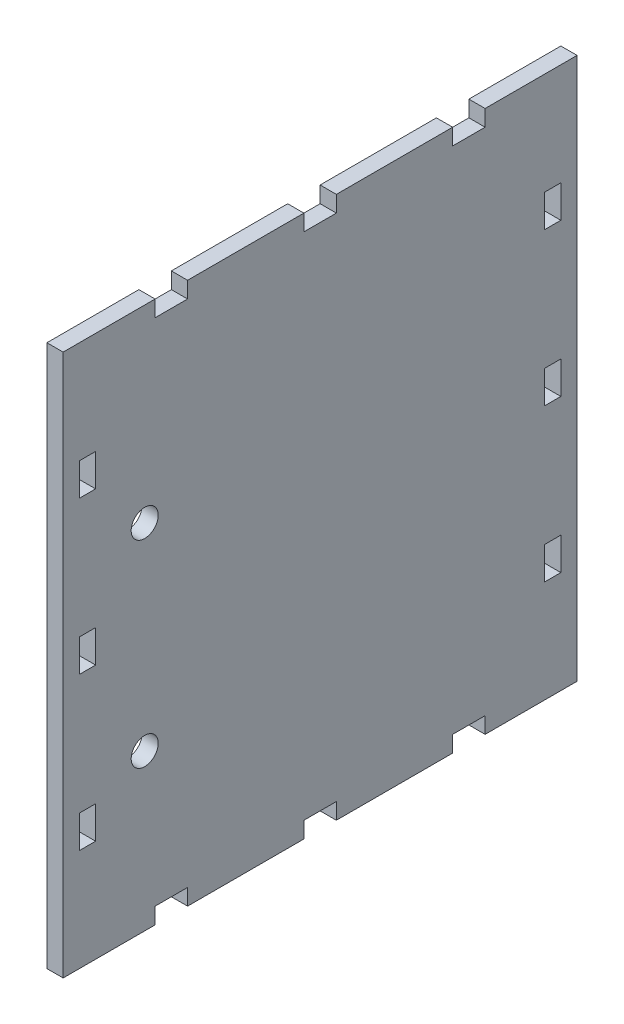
ISO-10303-21;
HEADER;
FILE_DESCRIPTION(('STEP AP214'),'2;1');
FILE_NAME('part.step','',(''),(''),'','','');
FILE_SCHEMA(('AUTOMOTIVE_DESIGN { 1 0 10303 214 1 1 1 1 }'));
ENDSEC;
DATA;
#1=APPLICATION_CONTEXT('core data for automotive mechanical design processes');
#2=APPLICATION_PROTOCOL_DEFINITION('international standard','automotive_design',2000,#1);
#3=PRODUCT_CONTEXT('',#1,'mechanical');
#4=PRODUCT('Part','Part','',(#3));
#5=PRODUCT_RELATED_PRODUCT_CATEGORY('part','',(#4));
#6=PRODUCT_DEFINITION_FORMATION('','',#4);
#7=PRODUCT_DEFINITION_CONTEXT('part definition',#1,'design');
#8=PRODUCT_DEFINITION('design','',#6,#7);
#9=PRODUCT_DEFINITION_SHAPE('','',#8);
#10=(LENGTH_UNIT() NAMED_UNIT(*) SI_UNIT(.MILLI.,.METRE.));
#11=(NAMED_UNIT(*) PLANE_ANGLE_UNIT() SI_UNIT($,.RADIAN.));
#12=(NAMED_UNIT(*) SI_UNIT($,.STERADIAN.) SOLID_ANGLE_UNIT());
#13=UNCERTAINTY_MEASURE_WITH_UNIT(LENGTH_MEASURE(1.E-05),#10,'distance_accuracy_value','');
#14=(GEOMETRIC_REPRESENTATION_CONTEXT(3) GLOBAL_UNCERTAINTY_ASSIGNED_CONTEXT((#13)) GLOBAL_UNIT_ASSIGNED_CONTEXT((#10,
#11,#12)) REPRESENTATION_CONTEXT('',''));
#15=CARTESIAN_POINT('',(0.,0.,0.));
#16=DIRECTION('',(0.,0.,1.));
#17=DIRECTION('',(1.,0.,0.));
#18=AXIS2_PLACEMENT_3D('',#15,#16,#17);
#19=CARTESIAN_POINT('',(50.1,0.,89.));
#20=DIRECTION('',(0.,0.,1.));
#21=DIRECTION('',(1.,0.,0.));
#22=AXIS2_PLACEMENT_3D('',#19,#20,#21);
#23=PLANE('',#22);
#24=DIRECTION('',(0.,1.,0.));
#25=VECTOR('',#24,1.);
#26=CARTESIAN_POINT('',(47.1,0.,89.));
#27=LINE('',#26,#25);
#28=CARTESIAN_POINT('',(47.1,25.2,89.));
#29=VERTEX_POINT('',#28);
#30=CARTESIAN_POINT('',(47.1,31.2,89.));
#31=VERTEX_POINT('',#30);
#32=EDGE_CURVE('E500',#29,#31,#27,.T.);
#33=ORIENTED_EDGE('',*,*,#32,.T.);
#34=DIRECTION('',(-1.,0.,0.));
#35=VECTOR('',#34,1.);
#36=CARTESIAN_POINT('',(50.1,31.2,89.));
#37=LINE('',#36,#35);
#38=CARTESIAN_POINT('',(50.1,31.2,89.));
#39=VERTEX_POINT('',#38);
#40=EDGE_CURVE('E10',#39,#31,#37,.T.);
#41=ORIENTED_EDGE('',*,*,#40,.F.);
#42=DIRECTION('',(0.,1.,0.));
#43=VECTOR('',#42,1.);
#44=CARTESIAN_POINT('',(50.1,0.,89.));
#45=LINE('',#44,#43);
#46=CARTESIAN_POINT('',(50.1,25.2,89.));
#47=VERTEX_POINT('',#46);
#48=EDGE_CURVE('E358',#47,#39,#45,.T.);
#49=ORIENTED_EDGE('',*,*,#48,.F.);
#50=DIRECTION('',(-1.,0.,0.));
#51=VECTOR('',#50,1.);
#52=CARTESIAN_POINT('',(50.1,25.2,89.));
#53=LINE('',#52,#51);
#54=EDGE_CURVE('E34',#47,#29,#53,.T.);
#55=ORIENTED_EDGE('',*,*,#54,.T.);
#56=EDGE_LOOP('',(#33,#41,#49,#55));
#57=FACE_BOUND('',#56,.T.);
#58=ADVANCED_FACE('F15',(#57),#23,.F.);
#59=CARTESIAN_POINT('',(50.1,31.2,0.));
#60=DIRECTION('',(0.,1.,0.));
#61=DIRECTION('',(0.,0.,1.));
#62=AXIS2_PLACEMENT_3D('',#59,#60,#61);
#63=PLANE('',#62);
#64=DIRECTION('',(0.,0.,-1.));
#65=VECTOR('',#64,1.);
#66=CARTESIAN_POINT('',(47.1,31.2,0.));
#67=LINE('',#66,#65);
#68=CARTESIAN_POINT('',(47.1,31.2,86.));
#69=VERTEX_POINT('',#68);
#70=EDGE_CURVE('E364',#31,#69,#67,.T.);
#71=ORIENTED_EDGE('',*,*,#70,.T.);
#72=DIRECTION('',(-1.,0.,0.));
#73=VECTOR('',#72,1.);
#74=CARTESIAN_POINT('',(50.1,31.2,86.));
#75=LINE('',#74,#73);
#76=CARTESIAN_POINT('',(50.1,31.2,86.));
#77=VERTEX_POINT('',#76);
#78=EDGE_CURVE('E25',#77,#69,#75,.T.);
#79=ORIENTED_EDGE('',*,*,#78,.F.);
#80=DIRECTION('',(0.,0.,-1.));
#81=VECTOR('',#80,1.);
#82=CARTESIAN_POINT('',(50.1,31.2,0.));
#83=LINE('',#82,#81);
#84=EDGE_CURVE('E352',#39,#77,#83,.T.);
#85=ORIENTED_EDGE('',*,*,#84,.F.);
#86=ORIENTED_EDGE('',*,*,#40,.T.);
#87=EDGE_LOOP('',(#71,#79,#85,#86));
#88=FACE_BOUND('',#87,.T.);
#89=ADVANCED_FACE('F363',(#88),#63,.F.);
#90=CARTESIAN_POINT('',(50.1,0.,86.));
#91=DIRECTION('',(0.,0.,1.));
#92=DIRECTION('',(1.,0.,0.));
#93=AXIS2_PLACEMENT_3D('',#90,#91,#92);
#94=PLANE('',#93);
#95=DIRECTION('',(0.,1.,0.));
#96=VECTOR('',#95,1.);
#97=CARTESIAN_POINT('',(47.1,0.,86.));
#98=LINE('',#97,#96);
#99=CARTESIAN_POINT('',(47.1,25.2,86.));
#100=VERTEX_POINT('',#99);
#101=EDGE_CURVE('E503',#100,#69,#98,.T.);
#102=ORIENTED_EDGE('',*,*,#101,.F.);
#103=DIRECTION('',(-1.,0.,0.));
#104=VECTOR('',#103,1.);
#105=CARTESIAN_POINT('',(50.1,25.2,86.));
#106=LINE('',#105,#104);
#107=CARTESIAN_POINT('',(50.1,25.2,86.));
#108=VERTEX_POINT('',#107);
#109=EDGE_CURVE('E192',#108,#100,#106,.T.);
#110=ORIENTED_EDGE('',*,*,#109,.F.);
#111=DIRECTION('',(0.,1.,0.));
#112=VECTOR('',#111,1.);
#113=CARTESIAN_POINT('',(50.1,0.,86.));
#114=LINE('',#113,#112);
#115=EDGE_CURVE('E357',#108,#77,#114,.T.);
#116=ORIENTED_EDGE('',*,*,#115,.T.);
#117=ORIENTED_EDGE('',*,*,#78,.T.);
#118=EDGE_LOOP('',(#102,#110,#116,#117));
#119=FACE_BOUND('',#118,.T.);
#120=ADVANCED_FACE('F368',(#119),#94,.T.);
#121=CARTESIAN_POINT('',(50.1,0.,89.));
#122=DIRECTION('',(0.,0.,1.));
#123=DIRECTION('',(1.,0.,0.));
#124=AXIS2_PLACEMENT_3D('',#121,#122,#123);
#125=PLANE('',#124);
#126=DIRECTION('',(0.,1.,0.));
#127=VECTOR('',#126,1.);
#128=CARTESIAN_POINT('',(47.1,0.,89.));
#129=LINE('',#128,#127);
#130=CARTESIAN_POINT('',(47.1,-31.2,89.));
#131=VERTEX_POINT('',#130);
#132=CARTESIAN_POINT('',(47.1,-25.2,89.));
#133=VERTEX_POINT('',#132);
#134=EDGE_CURVE('E488',#131,#133,#129,.T.);
#135=ORIENTED_EDGE('',*,*,#134,.T.);
#136=DIRECTION('',(-1.,0.,0.));
#137=VECTOR('',#136,1.);
#138=CARTESIAN_POINT('',(50.1,-25.2,89.));
#139=LINE('',#138,#137);
#140=CARTESIAN_POINT('',(50.1,-25.2,89.));
#141=VERTEX_POINT('',#140);
#142=EDGE_CURVE('E510',#141,#133,#139,.T.);
#143=ORIENTED_EDGE('',*,*,#142,.F.);
#144=DIRECTION('',(0.,1.,0.));
#145=VECTOR('',#144,1.);
#146=CARTESIAN_POINT('',(50.1,0.,89.));
#147=LINE('',#146,#145);
#148=CARTESIAN_POINT('',(50.1,-31.2,89.));
#149=VERTEX_POINT('',#148);
#150=EDGE_CURVE('E787',#149,#141,#147,.T.);
#151=ORIENTED_EDGE('',*,*,#150,.F.);
#152=DIRECTION('',(-1.,0.,0.));
#153=VECTOR('',#152,1.);
#154=CARTESIAN_POINT('',(50.1,-31.2,89.));
#155=LINE('',#154,#153);
#156=EDGE_CURVE('E512',#149,#131,#155,.T.);
#157=ORIENTED_EDGE('',*,*,#156,.T.);
#158=EDGE_LOOP('',(#135,#143,#151,#157));
#159=FACE_BOUND('',#158,.T.);
#160=ADVANCED_FACE('F813',(#159),#125,.F.);
#161=CARTESIAN_POINT('',(50.1,-25.2,0.));
#162=DIRECTION('',(0.,1.,0.));
#163=DIRECTION('',(0.,0.,1.));
#164=AXIS2_PLACEMENT_3D('',#161,#162,#163);
#165=PLANE('',#164);
#166=DIRECTION('',(0.,0.,-1.));
#167=VECTOR('',#166,1.);
#168=CARTESIAN_POINT('',(47.1,-25.2,0.));
#169=LINE('',#168,#167);
#170=CARTESIAN_POINT('',(47.1,-25.2,86.));
#171=VERTEX_POINT('',#170);
#172=EDGE_CURVE('E491',#133,#171,#169,.T.);
#173=ORIENTED_EDGE('',*,*,#172,.T.);
#174=DIRECTION('',(-1.,0.,0.));
#175=VECTOR('',#174,1.);
#176=CARTESIAN_POINT('',(50.1,-25.2,86.));
#177=LINE('',#176,#175);
#178=CARTESIAN_POINT('',(50.1,-25.2,86.));
#179=VERTEX_POINT('',#178);
#180=EDGE_CURVE('E517',#179,#171,#177,.T.);
#181=ORIENTED_EDGE('',*,*,#180,.F.);
#182=DIRECTION('',(0.,0.,-1.));
#183=VECTOR('',#182,1.);
#184=CARTESIAN_POINT('',(50.1,-25.2,0.));
#185=LINE('',#184,#183);
#186=EDGE_CURVE('E790',#141,#179,#185,.T.);
#187=ORIENTED_EDGE('',*,*,#186,.F.);
#188=ORIENTED_EDGE('',*,*,#142,.T.);
#189=EDGE_LOOP('',(#173,#181,#187,#188));
#190=FACE_BOUND('',#189,.T.);
#191=ADVANCED_FACE('F815',(#190),#165,.F.);
#192=CARTESIAN_POINT('',(50.1,0.,86.));
#193=DIRECTION('',(0.,0.,1.));
#194=DIRECTION('',(1.,0.,0.));
#195=AXIS2_PLACEMENT_3D('',#192,#193,#194);
#196=PLANE('',#195);
#197=DIRECTION('',(0.,1.,0.));
#198=VECTOR('',#197,1.);
#199=CARTESIAN_POINT('',(47.1,0.,86.));
#200=LINE('',#199,#198);
#201=CARTESIAN_POINT('',(47.1,-31.2,86.));
#202=VERTEX_POINT('',#201);
#203=EDGE_CURVE('E494',#202,#171,#200,.T.);
#204=ORIENTED_EDGE('',*,*,#203,.F.);
#205=DIRECTION('',(-1.,0.,0.));
#206=VECTOR('',#205,1.);
#207=CARTESIAN_POINT('',(50.1,-31.2,86.));
#208=LINE('',#207,#206);
#209=CARTESIAN_POINT('',(50.1,-31.2,86.));
#210=VERTEX_POINT('',#209);
#211=EDGE_CURVE('E514',#210,#202,#208,.T.);
#212=ORIENTED_EDGE('',*,*,#211,.F.);
#213=DIRECTION('',(0.,1.,0.));
#214=VECTOR('',#213,1.);
#215=CARTESIAN_POINT('',(50.1,0.,86.));
#216=LINE('',#215,#214);
#217=EDGE_CURVE('E792',#210,#179,#216,.T.);
#218=ORIENTED_EDGE('',*,*,#217,.T.);
#219=ORIENTED_EDGE('',*,*,#180,.T.);
#220=EDGE_LOOP('',(#204,#212,#218,#219));
#221=FACE_BOUND('',#220,.T.);
#222=ADVANCED_FACE('F808',(#221),#196,.T.);
#223=CARTESIAN_POINT('',(50.1,0.,3.));
#224=DIRECTION('',(0.,0.,1.));
#225=DIRECTION('',(1.,0.,0.));
#226=AXIS2_PLACEMENT_3D('',#223,#224,#225);
#227=PLANE('',#226);
#228=DIRECTION('',(0.,1.,0.));
#229=VECTOR('',#228,1.);
#230=CARTESIAN_POINT('',(47.1,0.,3.));
#231=LINE('',#230,#229);
#232=CARTESIAN_POINT('',(47.1,-3.00000000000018,3.));
#233=VERTEX_POINT('',#232);
#234=CARTESIAN_POINT('',(47.1,2.99999999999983,3.));
#235=VERTEX_POINT('',#234);
#236=EDGE_CURVE('E476',#233,#235,#231,.T.);
#237=ORIENTED_EDGE('',*,*,#236,.T.);
#238=DIRECTION('',(-1.,0.,0.));
#239=VECTOR('',#238,1.);
#240=CARTESIAN_POINT('',(50.1,2.99999999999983,3.));
#241=LINE('',#240,#239);
#242=CARTESIAN_POINT('',(50.1,2.99999999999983,3.));
#243=VERTEX_POINT('',#242);
#244=EDGE_CURVE('E515',#243,#235,#241,.T.);
#245=ORIENTED_EDGE('',*,*,#244,.F.);
#246=DIRECTION('',(0.,1.,0.));
#247=VECTOR('',#246,1.);
#248=CARTESIAN_POINT('',(50.1,0.,3.));
#249=LINE('',#248,#247);
#250=CARTESIAN_POINT('',(50.1,-3.00000000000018,3.));
#251=VERTEX_POINT('',#250);
#252=EDGE_CURVE('E776',#251,#243,#249,.T.);
#253=ORIENTED_EDGE('',*,*,#252,.F.);
#254=DIRECTION('',(-1.,0.,0.));
#255=VECTOR('',#254,1.);
#256=CARTESIAN_POINT('',(50.1,-3.00000000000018,3.));
#257=LINE('',#256,#255);
#258=EDGE_CURVE('E521',#251,#233,#257,.T.);
#259=ORIENTED_EDGE('',*,*,#258,.T.);
#260=EDGE_LOOP('',(#237,#245,#253,#259));
#261=FACE_BOUND('',#260,.T.);
#262=ADVANCED_FACE('F824',(#261),#227,.F.);
#263=CARTESIAN_POINT('',(50.1,2.99999999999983,0.));
#264=DIRECTION('',(0.,1.,0.));
#265=DIRECTION('',(0.,0.,1.));
#266=AXIS2_PLACEMENT_3D('',#263,#264,#265);
#267=PLANE('',#266);
#268=DIRECTION('',(0.,0.,-1.));
#269=VECTOR('',#268,1.);
#270=CARTESIAN_POINT('',(47.1,2.99999999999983,0.));
#271=LINE('',#270,#269);
#272=CARTESIAN_POINT('',(47.1,2.99999999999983,0.));
#273=VERTEX_POINT('',#272);
#274=EDGE_CURVE('E479',#235,#273,#271,.T.);
#275=ORIENTED_EDGE('',*,*,#274,.T.);
#276=DIRECTION('',(-1.,0.,0.));
#277=VECTOR('',#276,1.);
#278=CARTESIAN_POINT('',(50.1,2.99999999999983,0.));
#279=LINE('',#278,#277);
#280=CARTESIAN_POINT('',(50.1,2.99999999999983,0.));
#281=VERTEX_POINT('',#280);
#282=EDGE_CURVE('E526',#281,#273,#279,.T.);
#283=ORIENTED_EDGE('',*,*,#282,.F.);
#284=DIRECTION('',(0.,0.,-1.));
#285=VECTOR('',#284,1.);
#286=CARTESIAN_POINT('',(50.1,2.99999999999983,0.));
#287=LINE('',#286,#285);
#288=EDGE_CURVE('E779',#243,#281,#287,.T.);
#289=ORIENTED_EDGE('',*,*,#288,.F.);
#290=ORIENTED_EDGE('',*,*,#244,.T.);
#291=EDGE_LOOP('',(#275,#283,#289,#290));
#292=FACE_BOUND('',#291,.T.);
#293=ADVANCED_FACE('F982',(#292),#267,.F.);
#294=CARTESIAN_POINT('',(50.1,0.,0.));
#295=DIRECTION('',(0.,0.,1.));
#296=DIRECTION('',(0.,-1.,0.));
#297=AXIS2_PLACEMENT_3D('',#294,#295,#296);
#298=PLANE('',#297);
#299=DIRECTION('',(0.,1.,0.));
#300=VECTOR('',#299,1.);
#301=CARTESIAN_POINT('',(47.1,0.,0.));
#302=LINE('',#301,#300);
#303=CARTESIAN_POINT('',(47.1,-3.00000000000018,0.));
#304=VERTEX_POINT('',#303);
#305=EDGE_CURVE('E482',#304,#273,#302,.T.);
#306=ORIENTED_EDGE('',*,*,#305,.F.);
#307=DIRECTION('',(-1.,0.,0.));
#308=VECTOR('',#307,1.);
#309=CARTESIAN_POINT('',(50.1,-3.00000000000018,0.));
#310=LINE('',#309,#308);
#311=CARTESIAN_POINT('',(50.1,-3.00000000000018,0.));
#312=VERTEX_POINT('',#311);
#313=EDGE_CURVE('E523',#312,#304,#310,.T.);
#314=ORIENTED_EDGE('',*,*,#313,.F.);
#315=DIRECTION('',(0.,1.,0.));
#316=VECTOR('',#315,1.);
#317=CARTESIAN_POINT('',(50.1,0.,0.));
#318=LINE('',#317,#316);
#319=EDGE_CURVE('E781',#312,#281,#318,.T.);
#320=ORIENTED_EDGE('',*,*,#319,.T.);
#321=ORIENTED_EDGE('',*,*,#282,.T.);
#322=EDGE_LOOP('',(#306,#314,#320,#321));
#323=FACE_BOUND('',#322,.T.);
#324=ADVANCED_FACE('F985',(#323),#298,.T.);
#325=CARTESIAN_POINT('',(50.1,-25.2,0.));
#326=DIRECTION('',(0.,-1.,0.));
#327=DIRECTION('',(0.,0.,-1.));
#328=AXIS2_PLACEMENT_3D('',#325,#326,#327);
#329=PLANE('',#328);
#330=DIRECTION('',(0.,0.,1.));
#331=VECTOR('',#330,1.);
#332=CARTESIAN_POINT('',(47.1,-25.2,0.));
#333=LINE('',#332,#331);
#334=CARTESIAN_POINT('',(47.1,-25.2,0.));
#335=VERTEX_POINT('',#334);
#336=CARTESIAN_POINT('',(47.1,-25.2,3.));
#337=VERTEX_POINT('',#336);
#338=EDGE_CURVE('E464',#335,#337,#333,.T.);
#339=ORIENTED_EDGE('',*,*,#338,.F.);
#340=DIRECTION('',(-1.,0.,0.));
#341=VECTOR('',#340,1.);
#342=CARTESIAN_POINT('',(50.1,-25.2,0.));
#343=LINE('',#342,#341);
#344=CARTESIAN_POINT('',(50.1,-25.2,0.));
#345=VERTEX_POINT('',#344);
#346=EDGE_CURVE('E524',#345,#335,#343,.T.);
#347=ORIENTED_EDGE('',*,*,#346,.F.);
#348=DIRECTION('',(0.,0.,1.));
#349=VECTOR('',#348,1.);
#350=CARTESIAN_POINT('',(50.1,-25.2,0.));
#351=LINE('',#350,#349);
#352=CARTESIAN_POINT('',(50.1,-25.2,3.));
#353=VERTEX_POINT('',#352);
#354=EDGE_CURVE('E765',#345,#353,#351,.T.);
#355=ORIENTED_EDGE('',*,*,#354,.T.);
#356=DIRECTION('',(-1.,0.,0.));
#357=VECTOR('',#356,1.);
#358=CARTESIAN_POINT('',(50.1,-25.2,3.));
#359=LINE('',#358,#357);
#360=EDGE_CURVE('E530',#353,#337,#359,.T.);
#361=ORIENTED_EDGE('',*,*,#360,.T.);
#362=EDGE_LOOP('',(#339,#347,#355,#361));
#363=FACE_BOUND('',#362,.T.);
#364=ADVANCED_FACE('F1027',(#363),#329,.T.);
#365=CARTESIAN_POINT('',(50.1,0.,0.));
#366=DIRECTION('',(0.,0.,1.));
#367=DIRECTION('',(0.,-1.,0.));
#368=AXIS2_PLACEMENT_3D('',#365,#366,#367);
#369=PLANE('',#368);
#370=DIRECTION('',(0.,1.,0.));
#371=VECTOR('',#370,1.);
#372=CARTESIAN_POINT('',(47.1,0.,0.));
#373=LINE('',#372,#371);
#374=CARTESIAN_POINT('',(47.1,-31.2,0.));
#375=VERTEX_POINT('',#374);
#376=EDGE_CURVE('E467',#375,#335,#373,.T.);
#377=ORIENTED_EDGE('',*,*,#376,.F.);
#378=DIRECTION('',(-1.,0.,0.));
#379=VECTOR('',#378,1.);
#380=CARTESIAN_POINT('',(50.1,-31.2,0.));
#381=LINE('',#380,#379);
#382=CARTESIAN_POINT('',(50.1,-31.2,0.));
#383=VERTEX_POINT('',#382);
#384=EDGE_CURVE('E536',#383,#375,#381,.T.);
#385=ORIENTED_EDGE('',*,*,#384,.F.);
#386=DIRECTION('',(0.,1.,0.));
#387=VECTOR('',#386,1.);
#388=CARTESIAN_POINT('',(50.1,0.,0.));
#389=LINE('',#388,#387);
#390=EDGE_CURVE('E768',#383,#345,#389,.T.);
#391=ORIENTED_EDGE('',*,*,#390,.T.);
#392=ORIENTED_EDGE('',*,*,#346,.T.);
#393=EDGE_LOOP('',(#377,#385,#391,#392));
#394=FACE_BOUND('',#393,.T.);
#395=ADVANCED_FACE('F1057',(#394),#369,.T.);
#396=CARTESIAN_POINT('',(50.1,-31.2,0.));
#397=DIRECTION('',(0.,-1.,0.));
#398=DIRECTION('',(0.,0.,-1.));
#399=AXIS2_PLACEMENT_3D('',#396,#397,#398);
#400=PLANE('',#399);
#401=DIRECTION('',(0.,0.,1.));
#402=VECTOR('',#401,1.);
#403=CARTESIAN_POINT('',(47.1,-31.2,0.));
#404=LINE('',#403,#402);
#405=CARTESIAN_POINT('',(47.1,-31.2,3.));
#406=VERTEX_POINT('',#405);
#407=EDGE_CURVE('E470',#375,#406,#404,.T.);
#408=ORIENTED_EDGE('',*,*,#407,.T.);
#409=DIRECTION('',(-1.,0.,0.));
#410=VECTOR('',#409,1.);
#411=CARTESIAN_POINT('',(50.1,-31.2,3.));
#412=LINE('',#411,#410);
#413=CARTESIAN_POINT('',(50.1,-31.2,3.));
#414=VERTEX_POINT('',#413);
#415=EDGE_CURVE('E532',#414,#406,#412,.T.);
#416=ORIENTED_EDGE('',*,*,#415,.F.);
#417=DIRECTION('',(0.,0.,1.));
#418=VECTOR('',#417,1.);
#419=CARTESIAN_POINT('',(50.1,-31.2,0.));
#420=LINE('',#419,#418);
#421=EDGE_CURVE('E771',#383,#414,#420,.T.);
#422=ORIENTED_EDGE('',*,*,#421,.F.);
#423=ORIENTED_EDGE('',*,*,#384,.T.);
#424=EDGE_LOOP('',(#408,#416,#422,#423));
#425=FACE_BOUND('',#424,.T.);
#426=ADVANCED_FACE('F1052',(#425),#400,.F.);
#427=CARTESIAN_POINT('',(50.1,31.2,0.));
#428=DIRECTION('',(0.,-1.,0.));
#429=DIRECTION('',(0.,0.,-1.));
#430=AXIS2_PLACEMENT_3D('',#427,#428,#429);
#431=PLANE('',#430);
#432=DIRECTION('',(0.,0.,1.));
#433=VECTOR('',#432,1.);
#434=CARTESIAN_POINT('',(47.1,31.2,0.));
#435=LINE('',#434,#433);
#436=CARTESIAN_POINT('',(47.1,31.2,0.));
#437=VERTEX_POINT('',#436);
#438=CARTESIAN_POINT('',(47.1,31.2,3.));
#439=VERTEX_POINT('',#438);
#440=EDGE_CURVE('E452',#437,#439,#435,.T.);
#441=ORIENTED_EDGE('',*,*,#440,.F.);
#442=DIRECTION('',(-1.,0.,0.));
#443=VECTOR('',#442,1.);
#444=CARTESIAN_POINT('',(50.1,31.2,0.));
#445=LINE('',#444,#443);
#446=CARTESIAN_POINT('',(50.1,31.2,0.));
#447=VERTEX_POINT('',#446);
#448=EDGE_CURVE('E533',#447,#437,#445,.T.);
#449=ORIENTED_EDGE('',*,*,#448,.F.);
#450=DIRECTION('',(0.,0.,1.));
#451=VECTOR('',#450,1.);
#452=CARTESIAN_POINT('',(50.1,31.2,0.));
#453=LINE('',#452,#451);
#454=CARTESIAN_POINT('',(50.1,31.2,3.));
#455=VERTEX_POINT('',#454);
#456=EDGE_CURVE('E754',#447,#455,#453,.T.);
#457=ORIENTED_EDGE('',*,*,#456,.T.);
#458=DIRECTION('',(-1.,0.,0.));
#459=VECTOR('',#458,1.);
#460=CARTESIAN_POINT('',(50.1,31.2,3.));
#461=LINE('',#460,#459);
#462=EDGE_CURVE('E539',#455,#439,#461,.T.);
#463=ORIENTED_EDGE('',*,*,#462,.T.);
#464=EDGE_LOOP('',(#441,#449,#457,#463));
#465=FACE_BOUND('',#464,.T.);
#466=ADVANCED_FACE('F1056',(#465),#431,.T.);
#467=CARTESIAN_POINT('',(50.1,0.,0.));
#468=DIRECTION('',(0.,0.,1.));
#469=DIRECTION('',(0.,-1.,0.));
#470=AXIS2_PLACEMENT_3D('',#467,#468,#469);
#471=PLANE('',#470);
#472=DIRECTION('',(0.,1.,0.));
#473=VECTOR('',#472,1.);
#474=CARTESIAN_POINT('',(47.1,0.,0.));
#475=LINE('',#474,#473);
#476=CARTESIAN_POINT('',(47.1,25.2,0.));
#477=VERTEX_POINT('',#476);
#478=EDGE_CURVE('E455',#477,#437,#475,.T.);
#479=ORIENTED_EDGE('',*,*,#478,.F.);
#480=DIRECTION('',(-1.,0.,0.));
#481=VECTOR('',#480,1.);
#482=CARTESIAN_POINT('',(50.1,25.2,0.));
#483=LINE('',#482,#481);
#484=CARTESIAN_POINT('',(50.1,25.2,0.));
#485=VERTEX_POINT('',#484);
#486=EDGE_CURVE('E545',#485,#477,#483,.T.);
#487=ORIENTED_EDGE('',*,*,#486,.F.);
#488=DIRECTION('',(0.,1.,0.));
#489=VECTOR('',#488,1.);
#490=CARTESIAN_POINT('',(50.1,0.,0.));
#491=LINE('',#490,#489);
#492=EDGE_CURVE('E757',#485,#447,#491,.T.);
#493=ORIENTED_EDGE('',*,*,#492,.T.);
#494=ORIENTED_EDGE('',*,*,#448,.T.);
#495=EDGE_LOOP('',(#479,#487,#493,#494));
#496=FACE_BOUND('',#495,.T.);
#497=ADVANCED_FACE('F1089',(#496),#471,.T.);
#498=CARTESIAN_POINT('',(50.1,25.2,0.));
#499=DIRECTION('',(0.,-1.,0.));
#500=DIRECTION('',(0.,0.,-1.));
#501=AXIS2_PLACEMENT_3D('',#498,#499,#500);
#502=PLANE('',#501);
#503=DIRECTION('',(0.,0.,1.));
#504=VECTOR('',#503,1.);
#505=CARTESIAN_POINT('',(47.1,25.2,0.));
#506=LINE('',#505,#504);
#507=CARTESIAN_POINT('',(47.1,25.2,3.));
#508=VERTEX_POINT('',#507);
#509=EDGE_CURVE('E458',#477,#508,#506,.T.);
#510=ORIENTED_EDGE('',*,*,#509,.T.);
#511=DIRECTION('',(-1.,0.,0.));
#512=VECTOR('',#511,1.);
#513=CARTESIAN_POINT('',(50.1,25.2,3.));
#514=LINE('',#513,#512);
#515=CARTESIAN_POINT('',(50.1,25.2,3.));
#516=VERTEX_POINT('',#515);
#517=EDGE_CURVE('E541',#516,#508,#514,.T.);
#518=ORIENTED_EDGE('',*,*,#517,.F.);
#519=DIRECTION('',(0.,0.,1.));
#520=VECTOR('',#519,1.);
#521=CARTESIAN_POINT('',(50.1,25.2,0.));
#522=LINE('',#521,#520);
#523=EDGE_CURVE('E760',#485,#516,#522,.T.);
#524=ORIENTED_EDGE('',*,*,#523,.F.);
#525=ORIENTED_EDGE('',*,*,#486,.T.);
#526=EDGE_LOOP('',(#510,#518,#524,#525));
#527=FACE_BOUND('',#526,.T.);
#528=ADVANCED_FACE('F1084',(#527),#502,.F.);
#529=CARTESIAN_POINT('',(50.1,2.99999999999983,0.));
#530=DIRECTION('',(0.,-1.,0.));
#531=DIRECTION('',(0.,0.,-1.));
#532=AXIS2_PLACEMENT_3D('',#529,#530,#531);
#533=PLANE('',#532);
#534=DIRECTION('',(0.,0.,1.));
#535=VECTOR('',#534,1.);
#536=CARTESIAN_POINT('',(47.1,2.99999999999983,0.));
#537=LINE('',#536,#535);
#538=CARTESIAN_POINT('',(47.1,2.99999999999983,86.));
#539=VERTEX_POINT('',#538);
#540=CARTESIAN_POINT('',(47.1,2.99999999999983,89.));
#541=VERTEX_POINT('',#540);
#542=EDGE_CURVE('E440',#539,#541,#537,.T.);
#543=ORIENTED_EDGE('',*,*,#542,.F.);
#544=DIRECTION('',(-1.,0.,0.));
#545=VECTOR('',#544,1.);
#546=CARTESIAN_POINT('',(50.1,2.99999999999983,86.));
#547=LINE('',#546,#545);
#548=CARTESIAN_POINT('',(50.1,2.99999999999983,86.));
#549=VERTEX_POINT('',#548);
#550=EDGE_CURVE('E542',#549,#539,#547,.T.);
#551=ORIENTED_EDGE('',*,*,#550,.F.);
#552=DIRECTION('',(0.,0.,1.));
#553=VECTOR('',#552,1.);
#554=CARTESIAN_POINT('',(50.1,2.99999999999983,0.));
#555=LINE('',#554,#553);
#556=CARTESIAN_POINT('',(50.1,2.99999999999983,89.));
#557=VERTEX_POINT('',#556);
#558=EDGE_CURVE('E743',#549,#557,#555,.T.);
#559=ORIENTED_EDGE('',*,*,#558,.T.);
#560=DIRECTION('',(-1.,0.,0.));
#561=VECTOR('',#560,1.);
#562=CARTESIAN_POINT('',(50.1,2.99999999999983,89.));
#563=LINE('',#562,#561);
#564=EDGE_CURVE('E548',#557,#541,#563,.T.);
#565=ORIENTED_EDGE('',*,*,#564,.T.);
#566=EDGE_LOOP('',(#543,#551,#559,#565));
#567=FACE_BOUND('',#566,.T.);
#568=ADVANCED_FACE('F1088',(#567),#533,.T.);
#569=CARTESIAN_POINT('',(50.1,0.,86.));
#570=DIRECTION('',(0.,0.,1.));
#571=DIRECTION('',(1.,0.,0.));
#572=AXIS2_PLACEMENT_3D('',#569,#570,#571);
#573=PLANE('',#572);
#574=DIRECTION('',(0.,1.,0.));
#575=VECTOR('',#574,1.);
#576=CARTESIAN_POINT('',(47.1,0.,86.));
#577=LINE('',#576,#575);
#578=CARTESIAN_POINT('',(47.1,-3.00000000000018,86.));
#579=VERTEX_POINT('',#578);
#580=EDGE_CURVE('E443',#579,#539,#577,.T.);
#581=ORIENTED_EDGE('',*,*,#580,.F.);
#582=DIRECTION('',(-1.,0.,0.));
#583=VECTOR('',#582,1.);
#584=CARTESIAN_POINT('',(50.1,-3.00000000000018,86.));
#585=LINE('',#584,#583);
#586=CARTESIAN_POINT('',(50.1,-3.00000000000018,86.));
#587=VERTEX_POINT('',#586);
#588=EDGE_CURVE('E553',#587,#579,#585,.T.);
#589=ORIENTED_EDGE('',*,*,#588,.F.);
#590=DIRECTION('',(0.,1.,0.));
#591=VECTOR('',#590,1.);
#592=CARTESIAN_POINT('',(50.1,0.,86.));
#593=LINE('',#592,#591);
#594=EDGE_CURVE('E746',#587,#549,#593,.T.);
#595=ORIENTED_EDGE('',*,*,#594,.T.);
#596=ORIENTED_EDGE('',*,*,#550,.T.);
#597=EDGE_LOOP('',(#581,#589,#595,#596));
#598=FACE_BOUND('',#597,.T.);
#599=ADVANCED_FACE('F1119',(#598),#573,.T.);
#600=CARTESIAN_POINT('',(50.1,-3.00000000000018,0.));
#601=DIRECTION('',(0.,-1.,0.));
#602=DIRECTION('',(0.,0.,-1.));
#603=AXIS2_PLACEMENT_3D('',#600,#601,#602);
#604=PLANE('',#603);
#605=DIRECTION('',(0.,0.,1.));
#606=VECTOR('',#605,1.);
#607=CARTESIAN_POINT('',(47.1,-3.00000000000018,0.));
#608=LINE('',#607,#606);
#609=CARTESIAN_POINT('',(47.1,-3.00000000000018,89.));
#610=VERTEX_POINT('',#609);
#611=EDGE_CURVE('E446',#579,#610,#608,.T.);
#612=ORIENTED_EDGE('',*,*,#611,.T.);
#613=DIRECTION('',(-1.,0.,0.));
#614=VECTOR('',#613,1.);
#615=CARTESIAN_POINT('',(50.1,-3.00000000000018,89.));
#616=LINE('',#615,#614);
#617=CARTESIAN_POINT('',(50.1,-3.00000000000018,89.));
#618=VERTEX_POINT('',#617);
#619=EDGE_CURVE('E550',#618,#610,#616,.T.);
#620=ORIENTED_EDGE('',*,*,#619,.F.);
#621=DIRECTION('',(0.,0.,1.));
#622=VECTOR('',#621,1.);
#623=CARTESIAN_POINT('',(50.1,-3.00000000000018,0.));
#624=LINE('',#623,#622);
#625=EDGE_CURVE('E749',#587,#618,#624,.T.);
#626=ORIENTED_EDGE('',*,*,#625,.F.);
#627=ORIENTED_EDGE('',*,*,#588,.T.);
#628=EDGE_LOOP('',(#612,#620,#626,#627));
#629=FACE_BOUND('',#628,.T.);
#630=ADVANCED_FACE('F1115',(#629),#604,.F.);
#631=CARTESIAN_POINT('',(50.1,50.1,0.));
#632=DIRECTION('',(0.,1.,0.));
#633=DIRECTION('',(0.,0.,1.));
#634=AXIS2_PLACEMENT_3D('',#631,#632,#633);
#635=PLANE('',#634);
#636=DIRECTION('',(0.,0.,-1.));
#637=VECTOR('',#636,1.);
#638=CARTESIAN_POINT('',(47.1,50.1,0.));
#639=LINE('',#638,#637);
#640=CARTESIAN_POINT('',(47.1,50.1,92.));
#641=VERTEX_POINT('',#640);
#642=CARTESIAN_POINT('',(47.1,50.1,75.));
#643=VERTEX_POINT('',#642);
#644=EDGE_CURVE('E375',#641,#643,#639,.T.);
#645=ORIENTED_EDGE('',*,*,#644,.F.);
#646=DIRECTION('',(-1.,0.,0.));
#647=VECTOR('',#646,1.);
#648=CARTESIAN_POINT('',(50.1,50.1,92.));
#649=LINE('',#648,#647);
#650=CARTESIAN_POINT('',(50.1,50.1,92.));
#651=VERTEX_POINT('',#650);
#652=EDGE_CURVE('E19',#651,#641,#649,.T.);
#653=ORIENTED_EDGE('',*,*,#652,.F.);
#654=DIRECTION('',(0.,0.,-1.));
#655=VECTOR('',#654,1.);
#656=CARTESIAN_POINT('',(50.1,50.1,0.));
#657=LINE('',#656,#655);
#658=CARTESIAN_POINT('',(50.1,50.1,75.));
#659=VERTEX_POINT('',#658);
#660=EDGE_CURVE('E508',#651,#659,#657,.T.);
#661=ORIENTED_EDGE('',*,*,#660,.T.);
#662=DIRECTION('',(-1.,0.,0.));
#663=VECTOR('',#662,1.);
#664=CARTESIAN_POINT('',(50.1,50.1,75.));
#665=LINE('',#664,#663);
#666=EDGE_CURVE('E371',#659,#643,#665,.T.);
#667=ORIENTED_EDGE('',*,*,#666,.T.);
#668=EDGE_LOOP('',(#645,#653,#661,#667));
#669=FACE_BOUND('',#668,.T.);
#670=ADVANCED_FACE('F627',(#669),#635,.T.);
#671=CARTESIAN_POINT('',(50.1,0.,92.));
#672=DIRECTION('',(0.,0.,-1.));
#673=DIRECTION('',(-1.,0.,0.));
#674=AXIS2_PLACEMENT_3D('',#671,#672,#673);
#675=PLANE('',#674);
#676=DIRECTION('',(0.,-1.,0.));
#677=VECTOR('',#676,1.);
#678=CARTESIAN_POINT('',(47.1,0.,92.));
#679=LINE('',#678,#677);
#680=CARTESIAN_POINT('',(47.1,-50.1,92.));
#681=VERTEX_POINT('',#680);
#682=EDGE_CURVE('E378',#641,#681,#679,.T.);
#683=ORIENTED_EDGE('',*,*,#682,.T.);
#684=DIRECTION('',(-1.,0.,0.));
#685=VECTOR('',#684,1.);
#686=CARTESIAN_POINT('',(50.1,-50.1,92.));
#687=LINE('',#686,#685);
#688=CARTESIAN_POINT('',(50.1,-50.1,92.));
#689=VERTEX_POINT('',#688);
#690=EDGE_CURVE('E613',#689,#681,#687,.T.);
#691=ORIENTED_EDGE('',*,*,#690,.F.);
#692=DIRECTION('',(0.,-1.,0.));
#693=VECTOR('',#692,1.);
#694=CARTESIAN_POINT('',(50.1,0.,92.));
#695=LINE('',#694,#693);
#696=EDGE_CURVE('E621',#651,#689,#695,.T.);
#697=ORIENTED_EDGE('',*,*,#696,.F.);
#698=ORIENTED_EDGE('',*,*,#652,.T.);
#699=EDGE_LOOP('',(#683,#691,#697,#698));
#700=FACE_BOUND('',#699,.T.);
#701=ADVANCED_FACE('F17',(#700),#675,.F.);
#702=CARTESIAN_POINT('',(50.1,-50.1,0.));
#703=DIRECTION('',(0.,1.,0.));
#704=DIRECTION('',(0.,0.,1.));
#705=AXIS2_PLACEMENT_3D('',#702,#703,#704);
#706=PLANE('',#705);
#707=DIRECTION('',(0.,0.,-1.));
#708=VECTOR('',#707,1.);
#709=CARTESIAN_POINT('',(47.1,-50.1,0.));
#710=LINE('',#709,#708);
#711=CARTESIAN_POINT('',(47.1,-50.1,75.));
#712=VERTEX_POINT('',#711);
#713=EDGE_CURVE('E383',#681,#712,#710,.T.);
#714=ORIENTED_EDGE('',*,*,#713,.T.);
#715=DIRECTION('',(-1.,0.,0.));
#716=VECTOR('',#715,1.);
#717=CARTESIAN_POINT('',(50.1,-50.1,75.));
#718=LINE('',#717,#716);
#719=CARTESIAN_POINT('',(50.1,-50.1,75.));
#720=VERTEX_POINT('',#719);
#721=EDGE_CURVE('E612',#720,#712,#718,.T.);
#722=ORIENTED_EDGE('',*,*,#721,.F.);
#723=DIRECTION('',(0.,0.,-1.));
#724=VECTOR('',#723,1.);
#725=CARTESIAN_POINT('',(50.1,-50.1,0.));
#726=LINE('',#725,#724);
#727=EDGE_CURVE('E709',#689,#720,#726,.T.);
#728=ORIENTED_EDGE('',*,*,#727,.F.);
#729=ORIENTED_EDGE('',*,*,#690,.T.);
#730=EDGE_LOOP('',(#714,#722,#728,#729));
#731=FACE_BOUND('',#730,.T.);
#732=ADVANCED_FACE('F887',(#731),#706,.F.);
#733=CARTESIAN_POINT('',(50.1,-3.46944695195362E-13,75.));
#734=DIRECTION('',(0.,0.,-1.));
#735=DIRECTION('',(0.,1.,0.));
#736=AXIS2_PLACEMENT_3D('',#733,#734,#735);
#737=PLANE('',#736);
#738=DIRECTION('',(0.,-1.,0.));
#739=VECTOR('',#738,1.);
#740=CARTESIAN_POINT('',(47.1,-3.46944695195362E-13,75.));
#741=LINE('',#740,#739);
#742=CARTESIAN_POINT('',(47.1,-47.1,75.));
#743=VERTEX_POINT('',#742);
#744=EDGE_CURVE('E386',#743,#712,#741,.T.);
#745=ORIENTED_EDGE('',*,*,#744,.F.);
#746=DIRECTION('',(-1.,0.,0.));
#747=VECTOR('',#746,1.);
#748=CARTESIAN_POINT('',(50.1,-47.1,75.));
#749=LINE('',#748,#747);
#750=CARTESIAN_POINT('',(50.1,-47.1,75.));
#751=VERTEX_POINT('',#750);
#752=EDGE_CURVE('E610',#751,#743,#749,.T.);
#753=ORIENTED_EDGE('',*,*,#752,.F.);
#754=DIRECTION('',(0.,-1.,0.));
#755=VECTOR('',#754,1.);
#756=CARTESIAN_POINT('',(50.1,-3.46944695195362E-13,75.));
#757=LINE('',#756,#755);
#758=EDGE_CURVE('E932',#751,#720,#757,.T.);
#759=ORIENTED_EDGE('',*,*,#758,.T.);
#760=ORIENTED_EDGE('',*,*,#721,.T.);
#761=EDGE_LOOP('',(#745,#753,#759,#760));
#762=FACE_BOUND('',#761,.T.);
#763=ADVANCED_FACE('F916',(#762),#737,.T.);
#764=CARTESIAN_POINT('',(50.1,-47.1,0.));
#765=DIRECTION('',(0.,1.,0.));
#766=DIRECTION('',(0.,0.,1.));
#767=AXIS2_PLACEMENT_3D('',#764,#765,#766);
#768=PLANE('',#767);
#769=DIRECTION('',(0.,0.,-1.));
#770=VECTOR('',#769,1.);
#771=CARTESIAN_POINT('',(47.1,-47.1,0.));
#772=LINE('',#771,#770);
#773=CARTESIAN_POINT('',(47.1,-47.1,69.));
#774=VERTEX_POINT('',#773);
#775=EDGE_CURVE('E391',#743,#774,#772,.T.);
#776=ORIENTED_EDGE('',*,*,#775,.T.);
#777=DIRECTION('',(-1.,0.,0.));
#778=VECTOR('',#777,1.);
#779=CARTESIAN_POINT('',(50.1,-47.1,69.));
#780=LINE('',#779,#778);
#781=CARTESIAN_POINT('',(50.1,-47.1,69.));
#782=VERTEX_POINT('',#781);
#783=EDGE_CURVE('E607',#782,#774,#780,.T.);
#784=ORIENTED_EDGE('',*,*,#783,.F.);
#785=DIRECTION('',(0.,0.,-1.));
#786=VECTOR('',#785,1.);
#787=CARTESIAN_POINT('',(50.1,-47.1,0.));
#788=LINE('',#787,#786);
#789=EDGE_CURVE('E931',#751,#782,#788,.T.);
#790=ORIENTED_EDGE('',*,*,#789,.F.);
#791=ORIENTED_EDGE('',*,*,#752,.T.);
#792=EDGE_LOOP('',(#776,#784,#790,#791));
#793=FACE_BOUND('',#792,.T.);
#794=ADVANCED_FACE('F913',(#793),#768,.F.);
#795=CARTESIAN_POINT('',(50.1,3.19189119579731E-13,69.));
#796=DIRECTION('',(0.,0.,-1.));
#797=DIRECTION('',(0.,1.,0.));
#798=AXIS2_PLACEMENT_3D('',#795,#796,#797);
#799=PLANE('',#798);
#800=DIRECTION('',(0.,-1.,0.));
#801=VECTOR('',#800,1.);
#802=CARTESIAN_POINT('',(47.1,3.19189119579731E-13,69.));
#803=LINE('',#802,#801);
#804=CARTESIAN_POINT('',(47.1,-50.1,69.));
#805=VERTEX_POINT('',#804);
#806=EDGE_CURVE('E393',#774,#805,#803,.T.);
#807=ORIENTED_EDGE('',*,*,#806,.T.);
#808=DIRECTION('',(-1.,0.,0.));
#809=VECTOR('',#808,1.);
#810=CARTESIAN_POINT('',(50.1,-50.1,69.));
#811=LINE('',#810,#809);
#812=CARTESIAN_POINT('',(50.1,-50.1,69.));
#813=VERTEX_POINT('',#812);
#814=EDGE_CURVE('E604',#813,#805,#811,.T.);
#815=ORIENTED_EDGE('',*,*,#814,.F.);
#816=DIRECTION('',(0.,-1.,0.));
#817=VECTOR('',#816,1.);
#818=CARTESIAN_POINT('',(50.1,3.19189119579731E-13,69.));
#819=LINE('',#818,#817);
#820=EDGE_CURVE('E707',#782,#813,#819,.T.);
#821=ORIENTED_EDGE('',*,*,#820,.F.);
#822=ORIENTED_EDGE('',*,*,#783,.T.);
#823=EDGE_LOOP('',(#807,#815,#821,#822));
#824=FACE_BOUND('',#823,.T.);
#825=ADVANCED_FACE('F910',(#824),#799,.F.);
#826=CARTESIAN_POINT('',(47.1,-50.1,47.5));
#827=VERTEX_POINT('',#826);
#828=EDGE_CURVE('E388',#805,#827,#710,.T.);
#829=ORIENTED_EDGE('',*,*,#828,.T.);
#830=DIRECTION('',(-1.,0.,0.));
#831=VECTOR('',#830,1.);
#832=CARTESIAN_POINT('',(50.1,-50.1,47.5));
#833=LINE('',#832,#831);
#834=CARTESIAN_POINT('',(50.1,-50.1,47.5));
#835=VERTEX_POINT('',#834);
#836=EDGE_CURVE('E602',#835,#827,#833,.T.);
#837=ORIENTED_EDGE('',*,*,#836,.F.);
#838=EDGE_CURVE('E703',#813,#835,#726,.T.);
#839=ORIENTED_EDGE('',*,*,#838,.F.);
#840=ORIENTED_EDGE('',*,*,#814,.T.);
#841=EDGE_LOOP('',(#829,#837,#839,#840));
#842=FACE_BOUND('',#841,.T.);
#843=ADVANCED_FACE('F688',(#842),#706,.F.);
#844=CARTESIAN_POINT('',(50.1,0.,47.5));
#845=DIRECTION('',(0.,0.,-1.));
#846=DIRECTION('',(-1.,0.,0.));
#847=AXIS2_PLACEMENT_3D('',#844,#845,#846);
#848=PLANE('',#847);
#849=DIRECTION('',(0.,-1.,0.));
#850=VECTOR('',#849,1.);
#851=CARTESIAN_POINT('',(47.1,0.,47.5));
#852=LINE('',#851,#850);
#853=CARTESIAN_POINT('',(47.1,-47.1,47.5));
#854=VERTEX_POINT('',#853);
#855=EDGE_CURVE('E395',#854,#827,#852,.T.);
#856=ORIENTED_EDGE('',*,*,#855,.F.);
#857=DIRECTION('',(-1.,0.,0.));
#858=VECTOR('',#857,1.);
#859=CARTESIAN_POINT('',(50.1,-47.1,47.5));
#860=LINE('',#859,#858);
#861=CARTESIAN_POINT('',(50.1,-47.1,47.5));
#862=VERTEX_POINT('',#861);
#863=EDGE_CURVE('E600',#862,#854,#860,.T.);
#864=ORIENTED_EDGE('',*,*,#863,.F.);
#865=DIRECTION('',(0.,-1.,0.));
#866=VECTOR('',#865,1.);
#867=CARTESIAN_POINT('',(50.1,0.,47.5));
#868=LINE('',#867,#866);
#869=EDGE_CURVE('E700',#862,#835,#868,.T.);
#870=ORIENTED_EDGE('',*,*,#869,.T.);
#871=ORIENTED_EDGE('',*,*,#836,.T.);
#872=EDGE_LOOP('',(#856,#864,#870,#871));
#873=FACE_BOUND('',#872,.T.);
#874=ADVANCED_FACE('F697',(#873),#848,.T.);
#875=CARTESIAN_POINT('',(50.1,-47.1,0.));
#876=DIRECTION('',(0.,1.,0.));
#877=DIRECTION('',(0.,0.,1.));
#878=AXIS2_PLACEMENT_3D('',#875,#876,#877);
#879=PLANE('',#878);
#880=DIRECTION('',(0.,0.,-1.));
#881=VECTOR('',#880,1.);
#882=CARTESIAN_POINT('',(47.1,-47.1,0.));
#883=LINE('',#882,#881);
#884=CARTESIAN_POINT('',(47.1,-47.1,41.5));
#885=VERTEX_POINT('',#884);
#886=EDGE_CURVE('E398',#854,#885,#883,.T.);
#887=ORIENTED_EDGE('',*,*,#886,.T.);
#888=DIRECTION('',(-1.,0.,0.));
#889=VECTOR('',#888,1.);
#890=CARTESIAN_POINT('',(50.1,-47.1,41.5));
#891=LINE('',#890,#889);
#892=CARTESIAN_POINT('',(50.1,-47.1,41.5));
#893=VERTEX_POINT('',#892);
#894=EDGE_CURVE('E597',#893,#885,#891,.T.);
#895=ORIENTED_EDGE('',*,*,#894,.F.);
#896=DIRECTION('',(0.,0.,-1.));
#897=VECTOR('',#896,1.);
#898=CARTESIAN_POINT('',(50.1,-47.1,0.));
#899=LINE('',#898,#897);
#900=EDGE_CURVE('E702',#862,#893,#899,.T.);
#901=ORIENTED_EDGE('',*,*,#900,.F.);
#902=ORIENTED_EDGE('',*,*,#863,.T.);
#903=EDGE_LOOP('',(#887,#895,#901,#902));
#904=FACE_BOUND('',#903,.T.);
#905=ADVANCED_FACE('F903',(#904),#879,.F.);
#906=CARTESIAN_POINT('',(50.1,0.,41.5));
#907=DIRECTION('',(0.,0.,-1.));
#908=DIRECTION('',(-1.,0.,0.));
#909=AXIS2_PLACEMENT_3D('',#906,#907,#908);
#910=PLANE('',#909);
#911=DIRECTION('',(0.,-1.,0.));
#912=VECTOR('',#911,1.);
#913=CARTESIAN_POINT('',(47.1,0.,41.5));
#914=LINE('',#913,#912);
#915=CARTESIAN_POINT('',(47.1,-50.1,41.5));
#916=VERTEX_POINT('',#915);
#917=EDGE_CURVE('E400',#885,#916,#914,.T.);
#918=ORIENTED_EDGE('',*,*,#917,.T.);
#919=DIRECTION('',(-1.,0.,0.));
#920=VECTOR('',#919,1.);
#921=CARTESIAN_POINT('',(50.1,-50.1,41.5));
#922=LINE('',#921,#920);
#923=CARTESIAN_POINT('',(50.1,-50.1,41.5));
#924=VERTEX_POINT('',#923);
#925=EDGE_CURVE('E594',#924,#916,#922,.T.);
#926=ORIENTED_EDGE('',*,*,#925,.F.);
#927=DIRECTION('',(0.,-1.,0.));
#928=VECTOR('',#927,1.);
#929=CARTESIAN_POINT('',(50.1,0.,41.5));
#930=LINE('',#929,#928);
#931=EDGE_CURVE('E705',#893,#924,#930,.T.);
#932=ORIENTED_EDGE('',*,*,#931,.F.);
#933=ORIENTED_EDGE('',*,*,#894,.T.);
#934=EDGE_LOOP('',(#918,#926,#932,#933));
#935=FACE_BOUND('',#934,.T.);
#936=ADVANCED_FACE('F900',(#935),#910,.F.);
#937=CARTESIAN_POINT('',(47.1,-50.1,20.));
#938=VERTEX_POINT('',#937);
#939=EDGE_CURVE('E402',#916,#938,#710,.T.);
#940=ORIENTED_EDGE('',*,*,#939,.T.);
#941=DIRECTION('',(-1.,0.,0.));
#942=VECTOR('',#941,1.);
#943=CARTESIAN_POINT('',(50.1,-50.1,20.));
#944=LINE('',#943,#942);
#945=CARTESIAN_POINT('',(50.1,-50.1,20.));
#946=VERTEX_POINT('',#945);
#947=EDGE_CURVE('E592',#946,#938,#944,.T.);
#948=ORIENTED_EDGE('',*,*,#947,.F.);
#949=EDGE_CURVE('E710',#924,#946,#726,.T.);
#950=ORIENTED_EDGE('',*,*,#949,.F.);
#951=ORIENTED_EDGE('',*,*,#925,.T.);
#952=EDGE_LOOP('',(#940,#948,#950,#951));
#953=FACE_BOUND('',#952,.T.);
#954=ADVANCED_FACE('F888',(#953),#706,.F.);
#955=CARTESIAN_POINT('',(50.1,0.,20.));
#956=DIRECTION('',(0.,0.,-1.));
#957=DIRECTION('',(-1.,0.,0.));
#958=AXIS2_PLACEMENT_3D('',#955,#956,#957);
#959=PLANE('',#958);
#960=DIRECTION('',(0.,-1.,0.));
#961=VECTOR('',#960,1.);
#962=CARTESIAN_POINT('',(47.1,0.,20.));
#963=LINE('',#962,#961);
#964=CARTESIAN_POINT('',(47.1,-47.1,20.));
#965=VERTEX_POINT('',#964);
#966=EDGE_CURVE('E403',#965,#938,#963,.T.);
#967=ORIENTED_EDGE('',*,*,#966,.F.);
#968=DIRECTION('',(-1.,0.,0.));
#969=VECTOR('',#968,1.);
#970=CARTESIAN_POINT('',(50.1,-47.1,20.));
#971=LINE('',#970,#969);
#972=CARTESIAN_POINT('',(50.1,-47.1,20.));
#973=VERTEX_POINT('',#972);
#974=EDGE_CURVE('E590',#973,#965,#971,.T.);
#975=ORIENTED_EDGE('',*,*,#974,.F.);
#976=DIRECTION('',(0.,-1.,0.));
#977=VECTOR('',#976,1.);
#978=CARTESIAN_POINT('',(50.1,0.,20.));
#979=LINE('',#978,#977);
#980=EDGE_CURVE('E715',#973,#946,#979,.T.);
#981=ORIENTED_EDGE('',*,*,#980,.T.);
#982=ORIENTED_EDGE('',*,*,#947,.T.);
#983=EDGE_LOOP('',(#967,#975,#981,#982));
#984=FACE_BOUND('',#983,.T.);
#985=ADVANCED_FACE('F895',(#984),#959,.T.);
#986=CARTESIAN_POINT('',(50.1,-47.1,0.));
#987=DIRECTION('',(0.,1.,0.));
#988=DIRECTION('',(0.,0.,1.));
#989=AXIS2_PLACEMENT_3D('',#986,#987,#988);
#990=PLANE('',#989);
#991=DIRECTION('',(0.,0.,-1.));
#992=VECTOR('',#991,1.);
#993=CARTESIAN_POINT('',(47.1,-47.1,0.));
#994=LINE('',#993,#992);
#995=CARTESIAN_POINT('',(47.1,-47.1,14.));
#996=VERTEX_POINT('',#995);
#997=EDGE_CURVE('E406',#965,#996,#994,.T.);
#998=ORIENTED_EDGE('',*,*,#997,.T.);
#999=DIRECTION('',(-1.,0.,0.));
#1000=VECTOR('',#999,1.);
#1001=CARTESIAN_POINT('',(50.1,-47.1,14.));
#1002=LINE('',#1001,#1000);
#1003=CARTESIAN_POINT('',(50.1,-47.1,14.));
#1004=VERTEX_POINT('',#1003);
#1005=EDGE_CURVE('E587',#1004,#996,#1002,.T.);
#1006=ORIENTED_EDGE('',*,*,#1005,.F.);
#1007=DIRECTION('',(0.,0.,-1.));
#1008=VECTOR('',#1007,1.);
#1009=CARTESIAN_POINT('',(50.1,-47.1,0.));
#1010=LINE('',#1009,#1008);
#1011=EDGE_CURVE('E718',#973,#1004,#1010,.T.);
#1012=ORIENTED_EDGE('',*,*,#1011,.F.);
#1013=ORIENTED_EDGE('',*,*,#974,.T.);
#1014=EDGE_LOOP('',(#998,#1006,#1012,#1013));
#1015=FACE_BOUND('',#1014,.T.);
#1016=ADVANCED_FACE('F891',(#1015),#990,.F.);
#1017=CARTESIAN_POINT('',(50.1,0.,14.));
#1018=DIRECTION('',(0.,0.,-1.));
#1019=DIRECTION('',(0.,1.,0.));
#1020=AXIS2_PLACEMENT_3D('',#1017,#1018,#1019);
#1021=PLANE('',#1020);
#1022=DIRECTION('',(0.,-1.,0.));
#1023=VECTOR('',#1022,1.);
#1024=CARTESIAN_POINT('',(47.1,0.,14.));
#1025=LINE('',#1024,#1023);
#1026=CARTESIAN_POINT('',(47.1,-50.1,14.));
#1027=VERTEX_POINT('',#1026);
#1028=EDGE_CURVE('E408',#996,#1027,#1025,.T.);
#1029=ORIENTED_EDGE('',*,*,#1028,.T.);
#1030=DIRECTION('',(-1.,0.,0.));
#1031=VECTOR('',#1030,1.);
#1032=CARTESIAN_POINT('',(50.1,-50.1,14.));
#1033=LINE('',#1032,#1031);
#1034=CARTESIAN_POINT('',(50.1,-50.1,14.));
#1035=VERTEX_POINT('',#1034);
#1036=EDGE_CURVE('E584',#1035,#1027,#1033,.T.);
#1037=ORIENTED_EDGE('',*,*,#1036,.F.);
#1038=DIRECTION('',(0.,-1.,0.));
#1039=VECTOR('',#1038,1.);
#1040=CARTESIAN_POINT('',(50.1,0.,14.));
#1041=LINE('',#1040,#1039);
#1042=EDGE_CURVE('E720',#1004,#1035,#1041,.T.);
#1043=ORIENTED_EDGE('',*,*,#1042,.F.);
#1044=ORIENTED_EDGE('',*,*,#1005,.T.);
#1045=EDGE_LOOP('',(#1029,#1037,#1043,#1044));
#1046=FACE_BOUND('',#1045,.T.);
#1047=ADVANCED_FACE('F886',(#1046),#1021,.F.);
#1048=CARTESIAN_POINT('',(47.1,-50.1,-3.));
#1049=VERTEX_POINT('',#1048);
#1050=EDGE_CURVE('E387',#1027,#1049,#710,.T.);
#1051=ORIENTED_EDGE('',*,*,#1050,.T.);
#1052=DIRECTION('',(-1.,0.,0.));
#1053=VECTOR('',#1052,1.);
#1054=CARTESIAN_POINT('',(50.1,-50.1,-3.));
#1055=LINE('',#1054,#1053);
#1056=CARTESIAN_POINT('',(50.1,-50.1,-3.));
#1057=VERTEX_POINT('',#1056);
#1058=EDGE_CURVE('E582',#1057,#1049,#1055,.T.);
#1059=ORIENTED_EDGE('',*,*,#1058,.F.);
#1060=EDGE_CURVE('E722',#1035,#1057,#726,.T.);
#1061=ORIENTED_EDGE('',*,*,#1060,.F.);
#1062=ORIENTED_EDGE('',*,*,#1036,.T.);
#1063=EDGE_LOOP('',(#1051,#1059,#1061,#1062));
#1064=FACE_BOUND('',#1063,.T.);
#1065=ADVANCED_FACE('F677',(#1064),#706,.F.);
#1066=CARTESIAN_POINT('',(50.1,0.,-3.));
#1067=DIRECTION('',(0.,0.,-1.));
#1068=DIRECTION('',(0.,1.,0.));
#1069=AXIS2_PLACEMENT_3D('',#1066,#1067,#1068);
#1070=PLANE('',#1069);
#1071=DIRECTION('',(0.,-1.,0.));
#1072=VECTOR('',#1071,1.);
#1073=CARTESIAN_POINT('',(47.1,0.,-3.));
#1074=LINE('',#1073,#1072);
#1075=CARTESIAN_POINT('',(47.1,50.1,-3.));
#1076=VERTEX_POINT('',#1075);
#1077=EDGE_CURVE('E410',#1076,#1049,#1074,.T.);
#1078=ORIENTED_EDGE('',*,*,#1077,.F.);
#1079=DIRECTION('',(-1.,0.,0.));
#1080=VECTOR('',#1079,1.);
#1081=CARTESIAN_POINT('',(50.1,50.1,-3.));
#1082=LINE('',#1081,#1080);
#1083=CARTESIAN_POINT('',(50.1,50.1,-3.));
#1084=VERTEX_POINT('',#1083);
#1085=EDGE_CURVE('E580',#1084,#1076,#1082,.T.);
#1086=ORIENTED_EDGE('',*,*,#1085,.F.);
#1087=DIRECTION('',(0.,-1.,0.));
#1088=VECTOR('',#1087,1.);
#1089=CARTESIAN_POINT('',(50.1,0.,-3.));
#1090=LINE('',#1089,#1088);
#1091=EDGE_CURVE('E674',#1084,#1057,#1090,.T.);
#1092=ORIENTED_EDGE('',*,*,#1091,.T.);
#1093=ORIENTED_EDGE('',*,*,#1058,.T.);
#1094=EDGE_LOOP('',(#1078,#1086,#1092,#1093));
#1095=FACE_BOUND('',#1094,.T.);
#1096=ADVANCED_FACE('F671',(#1095),#1070,.T.);
#1097=CARTESIAN_POINT('',(47.1,50.1,14.));
#1098=VERTEX_POINT('',#1097);
#1099=EDGE_CURVE('E381',#1098,#1076,#639,.T.);
#1100=ORIENTED_EDGE('',*,*,#1099,.F.);
#1101=DIRECTION('',(-1.,0.,0.));
#1102=VECTOR('',#1101,1.);
#1103=CARTESIAN_POINT('',(50.1,50.1,14.));
#1104=LINE('',#1103,#1102);
#1105=CARTESIAN_POINT('',(50.1,50.1,14.));
#1106=VERTEX_POINT('',#1105);
#1107=EDGE_CURVE('E578',#1106,#1098,#1104,.T.);
#1108=ORIENTED_EDGE('',*,*,#1107,.F.);
#1109=EDGE_CURVE('E667',#1106,#1084,#657,.T.);
#1110=ORIENTED_EDGE('',*,*,#1109,.T.);
#1111=ORIENTED_EDGE('',*,*,#1085,.T.);
#1112=EDGE_LOOP('',(#1100,#1108,#1110,#1111));
#1113=FACE_BOUND('',#1112,.T.);
#1114=ADVANCED_FACE('F663',(#1113),#635,.T.);
#1115=CARTESIAN_POINT('',(50.1,0.,14.));
#1116=DIRECTION('',(0.,0.,-1.));
#1117=DIRECTION('',(-1.,0.,0.));
#1118=AXIS2_PLACEMENT_3D('',#1115,#1116,#1117);
#1119=PLANE('',#1118);
#1120=DIRECTION('',(0.,-1.,0.));
#1121=VECTOR('',#1120,1.);
#1122=CARTESIAN_POINT('',(47.1,0.,14.));
#1123=LINE('',#1122,#1121);
#1124=CARTESIAN_POINT('',(47.1,47.1,14.));
#1125=VERTEX_POINT('',#1124);
#1126=EDGE_CURVE('E413',#1098,#1125,#1123,.T.);
#1127=ORIENTED_EDGE('',*,*,#1126,.T.);
#1128=DIRECTION('',(-1.,0.,0.));
#1129=VECTOR('',#1128,1.);
#1130=CARTESIAN_POINT('',(50.1,47.1,14.));
#1131=LINE('',#1130,#1129);
#1132=CARTESIAN_POINT('',(50.1,47.1,14.));
#1133=VERTEX_POINT('',#1132);
#1134=EDGE_CURVE('E575',#1133,#1125,#1131,.T.);
#1135=ORIENTED_EDGE('',*,*,#1134,.F.);
#1136=DIRECTION('',(0.,-1.,0.));
#1137=VECTOR('',#1136,1.);
#1138=CARTESIAN_POINT('',(50.1,0.,14.));
#1139=LINE('',#1138,#1137);
#1140=EDGE_CURVE('E724',#1106,#1133,#1139,.T.);
#1141=ORIENTED_EDGE('',*,*,#1140,.F.);
#1142=ORIENTED_EDGE('',*,*,#1107,.T.);
#1143=EDGE_LOOP('',(#1127,#1135,#1141,#1142));
#1144=FACE_BOUND('',#1143,.T.);
#1145=ADVANCED_FACE('F877',(#1144),#1119,.F.);
#1146=CARTESIAN_POINT('',(50.1,47.1,0.));
#1147=DIRECTION('',(0.,-1.,0.));
#1148=DIRECTION('',(0.,0.,-1.));
#1149=AXIS2_PLACEMENT_3D('',#1146,#1147,#1148);
#1150=PLANE('',#1149);
#1151=DIRECTION('',(0.,0.,1.));
#1152=VECTOR('',#1151,1.);
#1153=CARTESIAN_POINT('',(47.1,47.1,0.));
#1154=LINE('',#1153,#1152);
#1155=CARTESIAN_POINT('',(47.1,47.1,20.));
#1156=VERTEX_POINT('',#1155);
#1157=EDGE_CURVE('E415',#1125,#1156,#1154,.T.);
#1158=ORIENTED_EDGE('',*,*,#1157,.T.);
#1159=DIRECTION('',(-1.,0.,0.));
#1160=VECTOR('',#1159,1.);
#1161=CARTESIAN_POINT('',(50.1,47.1,20.));
#1162=LINE('',#1161,#1160);
#1163=CARTESIAN_POINT('',(50.1,47.1,20.));
#1164=VERTEX_POINT('',#1163);
#1165=EDGE_CURVE('E573',#1164,#1156,#1162,.T.);
#1166=ORIENTED_EDGE('',*,*,#1165,.F.);
#1167=DIRECTION('',(0.,0.,1.));
#1168=VECTOR('',#1167,1.);
#1169=CARTESIAN_POINT('',(50.1,47.1,0.));
#1170=LINE('',#1169,#1168);
#1171=EDGE_CURVE('E726',#1133,#1164,#1170,.T.);
#1172=ORIENTED_EDGE('',*,*,#1171,.F.);
#1173=ORIENTED_EDGE('',*,*,#1134,.T.);
#1174=EDGE_LOOP('',(#1158,#1166,#1172,#1173));
#1175=FACE_BOUND('',#1174,.T.);
#1176=ADVANCED_FACE('F873',(#1175),#1150,.F.);
#1177=CARTESIAN_POINT('',(50.1,0.,20.));
#1178=DIRECTION('',(0.,0.,-1.));
#1179=DIRECTION('',(-1.,0.,0.));
#1180=AXIS2_PLACEMENT_3D('',#1177,#1178,#1179);
#1181=PLANE('',#1180);
#1182=DIRECTION('',(0.,-1.,0.));
#1183=VECTOR('',#1182,1.);
#1184=CARTESIAN_POINT('',(47.1,0.,20.));
#1185=LINE('',#1184,#1183);
#1186=CARTESIAN_POINT('',(47.1,50.1,20.));
#1187=VERTEX_POINT('',#1186);
#1188=EDGE_CURVE('E418',#1187,#1156,#1185,.T.);
#1189=ORIENTED_EDGE('',*,*,#1188,.F.);
#1190=DIRECTION('',(-1.,0.,0.));
#1191=VECTOR('',#1190,1.);
#1192=CARTESIAN_POINT('',(50.1,50.1,20.));
#1193=LINE('',#1192,#1191);
#1194=CARTESIAN_POINT('',(50.1,50.1,20.));
#1195=VERTEX_POINT('',#1194);
#1196=EDGE_CURVE('E571',#1195,#1187,#1193,.T.);
#1197=ORIENTED_EDGE('',*,*,#1196,.F.);
#1198=DIRECTION('',(0.,-1.,0.));
#1199=VECTOR('',#1198,1.);
#1200=CARTESIAN_POINT('',(50.1,0.,20.));
#1201=LINE('',#1200,#1199);
#1202=EDGE_CURVE('E728',#1195,#1164,#1201,.T.);
#1203=ORIENTED_EDGE('',*,*,#1202,.T.);
#1204=ORIENTED_EDGE('',*,*,#1165,.T.);
#1205=EDGE_LOOP('',(#1189,#1197,#1203,#1204));
#1206=FACE_BOUND('',#1205,.T.);
#1207=ADVANCED_FACE('F870',(#1206),#1181,.T.);
#1208=CARTESIAN_POINT('',(47.1,50.1,41.5));
#1209=VERTEX_POINT('',#1208);
#1210=EDGE_CURVE('E421',#1209,#1187,#639,.T.);
#1211=ORIENTED_EDGE('',*,*,#1210,.F.);
#1212=DIRECTION('',(-1.,0.,0.));
#1213=VECTOR('',#1212,1.);
#1214=CARTESIAN_POINT('',(50.1,50.1,41.5));
#1215=LINE('',#1214,#1213);
#1216=CARTESIAN_POINT('',(50.1,50.1,41.5));
#1217=VERTEX_POINT('',#1216);
#1218=EDGE_CURVE('E569',#1217,#1209,#1215,.T.);
#1219=ORIENTED_EDGE('',*,*,#1218,.F.);
#1220=EDGE_CURVE('E731',#1217,#1195,#657,.T.);
#1221=ORIENTED_EDGE('',*,*,#1220,.T.);
#1222=ORIENTED_EDGE('',*,*,#1196,.T.);
#1223=EDGE_LOOP('',(#1211,#1219,#1221,#1222));
#1224=FACE_BOUND('',#1223,.T.);
#1225=ADVANCED_FACE('F858',(#1224),#635,.T.);
#1226=CARTESIAN_POINT('',(50.1,0.,41.5));
#1227=DIRECTION('',(0.,0.,-1.));
#1228=DIRECTION('',(0.,1.,0.));
#1229=AXIS2_PLACEMENT_3D('',#1226,#1227,#1228);
#1230=PLANE('',#1229);
#1231=DIRECTION('',(0.,-1.,0.));
#1232=VECTOR('',#1231,1.);
#1233=CARTESIAN_POINT('',(47.1,0.,41.5));
#1234=LINE('',#1233,#1232);
#1235=CARTESIAN_POINT('',(47.1,47.1,41.5));
#1236=VERTEX_POINT('',#1235);
#1237=EDGE_CURVE('E422',#1209,#1236,#1234,.T.);
#1238=ORIENTED_EDGE('',*,*,#1237,.T.);
#1239=DIRECTION('',(-1.,0.,0.));
#1240=VECTOR('',#1239,1.);
#1241=CARTESIAN_POINT('',(50.1,47.1,41.5));
#1242=LINE('',#1241,#1240);
#1243=CARTESIAN_POINT('',(50.1,47.1,41.5));
#1244=VERTEX_POINT('',#1243);
#1245=EDGE_CURVE('E567',#1244,#1236,#1242,.T.);
#1246=ORIENTED_EDGE('',*,*,#1245,.F.);
#1247=DIRECTION('',(0.,-1.,0.));
#1248=VECTOR('',#1247,1.);
#1249=CARTESIAN_POINT('',(50.1,0.,41.5));
#1250=LINE('',#1249,#1248);
#1251=EDGE_CURVE('E732',#1217,#1244,#1250,.T.);
#1252=ORIENTED_EDGE('',*,*,#1251,.F.);
#1253=ORIENTED_EDGE('',*,*,#1218,.T.);
#1254=EDGE_LOOP('',(#1238,#1246,#1252,#1253));
#1255=FACE_BOUND('',#1254,.T.);
#1256=ADVANCED_FACE('F865',(#1255),#1230,.F.);
#1257=CARTESIAN_POINT('',(50.1,47.1,0.));
#1258=DIRECTION('',(0.,1.,0.));
#1259=DIRECTION('',(0.,0.,1.));
#1260=AXIS2_PLACEMENT_3D('',#1257,#1258,#1259);
#1261=PLANE('',#1260);
#1262=DIRECTION('',(0.,0.,-1.));
#1263=VECTOR('',#1262,1.);
#1264=CARTESIAN_POINT('',(47.1,47.1,0.));
#1265=LINE('',#1264,#1263);
#1266=CARTESIAN_POINT('',(47.1,47.1,47.5));
#1267=VERTEX_POINT('',#1266);
#1268=EDGE_CURVE('E425',#1267,#1236,#1265,.T.);
#1269=ORIENTED_EDGE('',*,*,#1268,.F.);
#1270=DIRECTION('',(-1.,0.,0.));
#1271=VECTOR('',#1270,1.);
#1272=CARTESIAN_POINT('',(50.1,47.1,47.5));
#1273=LINE('',#1272,#1271);
#1274=CARTESIAN_POINT('',(50.1,47.1,47.5));
#1275=VERTEX_POINT('',#1274);
#1276=EDGE_CURVE('E565',#1275,#1267,#1273,.T.);
#1277=ORIENTED_EDGE('',*,*,#1276,.F.);
#1278=DIRECTION('',(0.,0.,-1.));
#1279=VECTOR('',#1278,1.);
#1280=CARTESIAN_POINT('',(50.1,47.1,0.));
#1281=LINE('',#1280,#1279);
#1282=EDGE_CURVE('E734',#1275,#1244,#1281,.T.);
#1283=ORIENTED_EDGE('',*,*,#1282,.T.);
#1284=ORIENTED_EDGE('',*,*,#1245,.T.);
#1285=EDGE_LOOP('',(#1269,#1277,#1283,#1284));
#1286=FACE_BOUND('',#1285,.T.);
#1287=ADVANCED_FACE('F861',(#1286),#1261,.T.);
#1288=CARTESIAN_POINT('',(50.1,-1.09865820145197E-13,47.5));
#1289=DIRECTION('',(0.,0.,-1.));
#1290=DIRECTION('',(0.,1.,0.));
#1291=AXIS2_PLACEMENT_3D('',#1288,#1289,#1290);
#1292=PLANE('',#1291);
#1293=DIRECTION('',(0.,-1.,0.));
#1294=VECTOR('',#1293,1.);
#1295=CARTESIAN_POINT('',(47.1,-1.09865820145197E-13,47.5));
#1296=LINE('',#1295,#1294);
#1297=CARTESIAN_POINT('',(47.1,50.1,47.5));
#1298=VERTEX_POINT('',#1297);
#1299=EDGE_CURVE('E428',#1298,#1267,#1296,.T.);
#1300=ORIENTED_EDGE('',*,*,#1299,.F.);
#1301=DIRECTION('',(-1.,0.,0.));
#1302=VECTOR('',#1301,1.);
#1303=CARTESIAN_POINT('',(50.1,50.1,47.5));
#1304=LINE('',#1303,#1302);
#1305=CARTESIAN_POINT('',(50.1,50.1,47.5));
#1306=VERTEX_POINT('',#1305);
#1307=EDGE_CURVE('E563',#1306,#1298,#1304,.T.);
#1308=ORIENTED_EDGE('',*,*,#1307,.F.);
#1309=DIRECTION('',(0.,-1.,0.));
#1310=VECTOR('',#1309,1.);
#1311=CARTESIAN_POINT('',(50.1,-1.09865820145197E-13,47.5));
#1312=LINE('',#1311,#1310);
#1313=EDGE_CURVE('E737',#1306,#1275,#1312,.T.);
#1314=ORIENTED_EDGE('',*,*,#1313,.T.);
#1315=ORIENTED_EDGE('',*,*,#1276,.T.);
#1316=EDGE_LOOP('',(#1300,#1308,#1314,#1315));
#1317=FACE_BOUND('',#1316,.T.);
#1318=ADVANCED_FACE('F857',(#1317),#1292,.T.);
#1319=CARTESIAN_POINT('',(47.1,50.1,69.));
#1320=VERTEX_POINT('',#1319);
#1321=EDGE_CURVE('E380',#1320,#1298,#639,.T.);
#1322=ORIENTED_EDGE('',*,*,#1321,.F.);
#1323=DIRECTION('',(-1.,0.,0.));
#1324=VECTOR('',#1323,1.);
#1325=CARTESIAN_POINT('',(50.1,50.1,69.));
#1326=LINE('',#1325,#1324);
#1327=CARTESIAN_POINT('',(50.1,50.1,69.));
#1328=VERTEX_POINT('',#1327);
#1329=EDGE_CURVE('E561',#1328,#1320,#1326,.T.);
#1330=ORIENTED_EDGE('',*,*,#1329,.F.);
#1331=EDGE_CURVE('E651',#1328,#1306,#657,.T.);
#1332=ORIENTED_EDGE('',*,*,#1331,.T.);
#1333=ORIENTED_EDGE('',*,*,#1307,.T.);
#1334=EDGE_LOOP('',(#1322,#1330,#1332,#1333));
#1335=FACE_BOUND('',#1334,.T.);
#1336=ADVANCED_FACE('F650',(#1335),#635,.T.);
#1337=CARTESIAN_POINT('',(50.1,0.,69.));
#1338=DIRECTION('',(0.,0.,-1.));
#1339=DIRECTION('',(-1.,0.,0.));
#1340=AXIS2_PLACEMENT_3D('',#1337,#1338,#1339);
#1341=PLANE('',#1340);
#1342=DIRECTION('',(0.,-1.,0.));
#1343=VECTOR('',#1342,1.);
#1344=CARTESIAN_POINT('',(47.1,0.,69.));
#1345=LINE('',#1344,#1343);
#1346=CARTESIAN_POINT('',(47.1,47.1,69.));
#1347=VERTEX_POINT('',#1346);
#1348=EDGE_CURVE('E431',#1320,#1347,#1345,.T.);
#1349=ORIENTED_EDGE('',*,*,#1348,.T.);
#1350=DIRECTION('',(-1.,0.,0.));
#1351=VECTOR('',#1350,1.);
#1352=CARTESIAN_POINT('',(50.1,47.1,69.));
#1353=LINE('',#1352,#1351);
#1354=CARTESIAN_POINT('',(50.1,47.1,69.));
#1355=VERTEX_POINT('',#1354);
#1356=EDGE_CURVE('E559',#1355,#1347,#1353,.T.);
#1357=ORIENTED_EDGE('',*,*,#1356,.F.);
#1358=DIRECTION('',(0.,-1.,0.));
#1359=VECTOR('',#1358,1.);
#1360=CARTESIAN_POINT('',(50.1,0.,69.));
#1361=LINE('',#1360,#1359);
#1362=EDGE_CURVE('E646',#1328,#1355,#1361,.T.);
#1363=ORIENTED_EDGE('',*,*,#1362,.F.);
#1364=ORIENTED_EDGE('',*,*,#1329,.T.);
#1365=EDGE_LOOP('',(#1349,#1357,#1363,#1364));
#1366=FACE_BOUND('',#1365,.T.);
#1367=ADVANCED_FACE('F645',(#1366),#1341,.F.);
#1368=CARTESIAN_POINT('',(50.1,47.1,0.));
#1369=DIRECTION('',(0.,1.,0.));
#1370=DIRECTION('',(0.,0.,1.));
#1371=AXIS2_PLACEMENT_3D('',#1368,#1369,#1370);
#1372=PLANE('',#1371);
#1373=DIRECTION('',(0.,0.,-1.));
#1374=VECTOR('',#1373,1.);
#1375=CARTESIAN_POINT('',(47.1,47.1,0.));
#1376=LINE('',#1375,#1374);
#1377=CARTESIAN_POINT('',(47.1,47.1,75.));
#1378=VERTEX_POINT('',#1377);
#1379=EDGE_CURVE('E434',#1378,#1347,#1376,.T.);
#1380=ORIENTED_EDGE('',*,*,#1379,.F.);
#1381=DIRECTION('',(-1.,0.,0.));
#1382=VECTOR('',#1381,1.);
#1383=CARTESIAN_POINT('',(50.1,47.1,75.));
#1384=LINE('',#1383,#1382);
#1385=CARTESIAN_POINT('',(50.1,47.1,75.));
#1386=VERTEX_POINT('',#1385);
#1387=EDGE_CURVE('E557',#1386,#1378,#1384,.T.);
#1388=ORIENTED_EDGE('',*,*,#1387,.F.);
#1389=DIRECTION('',(0.,0.,-1.));
#1390=VECTOR('',#1389,1.);
#1391=CARTESIAN_POINT('',(50.1,47.1,0.));
#1392=LINE('',#1391,#1390);
#1393=EDGE_CURVE('E642',#1386,#1355,#1392,.T.);
#1394=ORIENTED_EDGE('',*,*,#1393,.T.);
#1395=ORIENTED_EDGE('',*,*,#1356,.T.);
#1396=EDGE_LOOP('',(#1380,#1388,#1394,#1395));
#1397=FACE_BOUND('',#1396,.T.);
#1398=ADVANCED_FACE('F638',(#1397),#1372,.T.);
#1399=CARTESIAN_POINT('',(50.1,-31.2,0.));
#1400=DIRECTION('',(0.,1.,0.));
#1401=DIRECTION('',(0.,0.,1.));
#1402=AXIS2_PLACEMENT_3D('',#1399,#1400,#1401);
#1403=PLANE('',#1402);
#1404=DIRECTION('',(0.,0.,-1.));
#1405=VECTOR('',#1404,1.);
#1406=CARTESIAN_POINT('',(47.1,-31.2,0.));
#1407=LINE('',#1406,#1405);
#1408=EDGE_CURVE('E497',#131,#202,#1407,.T.);
#1409=ORIENTED_EDGE('',*,*,#1408,.F.);
#1410=ORIENTED_EDGE('',*,*,#156,.F.);
#1411=DIRECTION('',(0.,0.,-1.));
#1412=VECTOR('',#1411,1.);
#1413=CARTESIAN_POINT('',(50.1,-31.2,0.));
#1414=LINE('',#1413,#1412);
#1415=EDGE_CURVE('E795',#149,#210,#1414,.T.);
#1416=ORIENTED_EDGE('',*,*,#1415,.T.);
#1417=ORIENTED_EDGE('',*,*,#211,.T.);
#1418=EDGE_LOOP('',(#1409,#1410,#1416,#1417));
#1419=FACE_BOUND('',#1418,.T.);
#1420=ADVANCED_FACE('F800',(#1419),#1403,.T.);
#1421=CARTESIAN_POINT('',(50.1,-3.00000000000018,0.));
#1422=DIRECTION('',(0.,1.,0.));
#1423=DIRECTION('',(0.,0.,1.));
#1424=AXIS2_PLACEMENT_3D('',#1421,#1422,#1423);
#1425=PLANE('',#1424);
#1426=DIRECTION('',(0.,0.,-1.));
#1427=VECTOR('',#1426,1.);
#1428=CARTESIAN_POINT('',(47.1,-3.00000000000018,0.));
#1429=LINE('',#1428,#1427);
#1430=EDGE_CURVE('E485',#233,#304,#1429,.T.);
#1431=ORIENTED_EDGE('',*,*,#1430,.F.);
#1432=ORIENTED_EDGE('',*,*,#258,.F.);
#1433=DIRECTION('',(0.,0.,-1.));
#1434=VECTOR('',#1433,1.);
#1435=CARTESIAN_POINT('',(50.1,-3.00000000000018,0.));
#1436=LINE('',#1435,#1434);
#1437=EDGE_CURVE('E784',#251,#312,#1436,.T.);
#1438=ORIENTED_EDGE('',*,*,#1437,.T.);
#1439=ORIENTED_EDGE('',*,*,#313,.T.);
#1440=EDGE_LOOP('',(#1431,#1432,#1438,#1439));
#1441=FACE_BOUND('',#1440,.T.);
#1442=ADVANCED_FACE('F837',(#1441),#1425,.T.);
#1443=CARTESIAN_POINT('',(50.1,0.,3.00000000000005));
#1444=DIRECTION('',(0.,0.,1.));
#1445=DIRECTION('',(0.,-1.,0.));
#1446=AXIS2_PLACEMENT_3D('',#1443,#1444,#1445);
#1447=PLANE('',#1446);
#1448=DIRECTION('',(0.,1.,0.));
#1449=VECTOR('',#1448,1.);
#1450=CARTESIAN_POINT('',(47.1,0.,3.00000000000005));
#1451=LINE('',#1450,#1449);
#1452=EDGE_CURVE('E473',#406,#337,#1451,.T.);
#1453=ORIENTED_EDGE('',*,*,#1452,.T.);
#1454=ORIENTED_EDGE('',*,*,#360,.F.);
#1455=DIRECTION('',(0.,1.,0.));
#1456=VECTOR('',#1455,1.);
#1457=CARTESIAN_POINT('',(50.1,0.,3.00000000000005));
#1458=LINE('',#1457,#1456);
#1459=EDGE_CURVE('E774',#414,#353,#1458,.T.);
#1460=ORIENTED_EDGE('',*,*,#1459,.F.);
#1461=ORIENTED_EDGE('',*,*,#415,.T.);
#1462=EDGE_LOOP('',(#1453,#1454,#1460,#1461));
#1463=FACE_BOUND('',#1462,.T.);
#1464=ADVANCED_FACE('F843',(#1463),#1447,.F.);
#1465=CARTESIAN_POINT('',(50.1,0.,3.));
#1466=DIRECTION('',(0.,0.,1.));
#1467=DIRECTION('',(0.,-1.,0.));
#1468=AXIS2_PLACEMENT_3D('',#1465,#1466,#1467);
#1469=PLANE('',#1468);
#1470=DIRECTION('',(0.,1.,0.));
#1471=VECTOR('',#1470,1.);
#1472=CARTESIAN_POINT('',(47.1,0.,3.));
#1473=LINE('',#1472,#1471);
#1474=EDGE_CURVE('E461',#508,#439,#1473,.T.);
#1475=ORIENTED_EDGE('',*,*,#1474,.T.);
#1476=ORIENTED_EDGE('',*,*,#462,.F.);
#1477=DIRECTION('',(0.,1.,0.));
#1478=VECTOR('',#1477,1.);
#1479=CARTESIAN_POINT('',(50.1,0.,3.));
#1480=LINE('',#1479,#1478);
#1481=EDGE_CURVE('E763',#516,#455,#1480,.T.);
#1482=ORIENTED_EDGE('',*,*,#1481,.F.);
#1483=ORIENTED_EDGE('',*,*,#517,.T.);
#1484=EDGE_LOOP('',(#1475,#1476,#1482,#1483));
#1485=FACE_BOUND('',#1484,.T.);
#1486=ADVANCED_FACE('F1046',(#1485),#1469,.F.);
#1487=CARTESIAN_POINT('',(50.1,0.,89.));
#1488=DIRECTION('',(0.,0.,1.));
#1489=DIRECTION('',(1.,0.,0.));
#1490=AXIS2_PLACEMENT_3D('',#1487,#1488,#1489);
#1491=PLANE('',#1490);
#1492=DIRECTION('',(0.,1.,0.));
#1493=VECTOR('',#1492,1.);
#1494=CARTESIAN_POINT('',(47.1,0.,89.));
#1495=LINE('',#1494,#1493);
#1496=EDGE_CURVE('E449',#610,#541,#1495,.T.);
#1497=ORIENTED_EDGE('',*,*,#1496,.T.);
#1498=ORIENTED_EDGE('',*,*,#564,.F.);
#1499=DIRECTION('',(0.,1.,0.));
#1500=VECTOR('',#1499,1.);
#1501=CARTESIAN_POINT('',(50.1,0.,89.));
#1502=LINE('',#1501,#1500);
#1503=EDGE_CURVE('E752',#618,#557,#1502,.T.);
#1504=ORIENTED_EDGE('',*,*,#1503,.F.);
#1505=ORIENTED_EDGE('',*,*,#619,.T.);
#1506=EDGE_LOOP('',(#1497,#1498,#1504,#1505));
#1507=FACE_BOUND('',#1506,.T.);
#1508=ADVANCED_FACE('F1078',(#1507),#1491,.F.);
#1509=CARTESIAN_POINT('',(50.1,0.,75.));
#1510=DIRECTION('',(0.,0.,-1.));
#1511=DIRECTION('',(-1.,0.,0.));
#1512=AXIS2_PLACEMENT_3D('',#1509,#1510,#1511);
#1513=PLANE('',#1512);
#1514=DIRECTION('',(0.,-1.,0.));
#1515=VECTOR('',#1514,1.);
#1516=CARTESIAN_POINT('',(47.1,0.,75.));
#1517=LINE('',#1516,#1515);
#1518=EDGE_CURVE('E437',#643,#1378,#1517,.T.);
#1519=ORIENTED_EDGE('',*,*,#1518,.F.);
#1520=ORIENTED_EDGE('',*,*,#666,.F.);
#1521=DIRECTION('',(0.,-1.,0.));
#1522=VECTOR('',#1521,1.);
#1523=CARTESIAN_POINT('',(50.1,0.,75.));
#1524=LINE('',#1523,#1522);
#1525=EDGE_CURVE('E632',#659,#1386,#1524,.T.);
#1526=ORIENTED_EDGE('',*,*,#1525,.T.);
#1527=ORIENTED_EDGE('',*,*,#1387,.T.);
#1528=EDGE_LOOP('',(#1519,#1520,#1526,#1527));
#1529=FACE_BOUND('',#1528,.T.);
#1530=ADVANCED_FACE('F631',(#1529),#1513,.T.);
#1531=CARTESIAN_POINT('',(50.1,25.2,0.));
#1532=DIRECTION('',(0.,1.,0.));
#1533=DIRECTION('',(0.,0.,1.));
#1534=AXIS2_PLACEMENT_3D('',#1531,#1532,#1533);
#1535=PLANE('',#1534);
#1536=DIRECTION('',(0.,0.,-1.));
#1537=VECTOR('',#1536,1.);
#1538=CARTESIAN_POINT('',(47.1,25.2,0.));
#1539=LINE('',#1538,#1537);
#1540=EDGE_CURVE('E505',#29,#100,#1539,.T.);
#1541=ORIENTED_EDGE('',*,*,#1540,.F.);
#1542=ORIENTED_EDGE('',*,*,#54,.F.);
#1543=DIRECTION('',(0.,0.,-1.));
#1544=VECTOR('',#1543,1.);
#1545=CARTESIAN_POINT('',(50.1,25.2,0.));
#1546=LINE('',#1545,#1544);
#1547=EDGE_CURVE('E369',#47,#108,#1546,.T.);
#1548=ORIENTED_EDGE('',*,*,#1547,.T.);
#1549=ORIENTED_EDGE('',*,*,#109,.T.);
#1550=EDGE_LOOP('',(#1541,#1542,#1548,#1549));
#1551=FACE_BOUND('',#1550,.T.);
#1552=ADVANCED_FACE('F961',(#1551),#1535,.T.);
#1553=CARTESIAN_POINT('',(50.1,0.,0.));
#1554=DIRECTION('',(1.,0.,0.));
#1555=DIRECTION('',(0.,0.,-1.));
#1556=AXIS2_PLACEMENT_3D('',#1553,#1554,#1555);
#1557=PLANE('',#1556);
#1558=CARTESIAN_POINT('',(50.1,15.2187622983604,76.9264950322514));
#1559=DIRECTION('',(1.,0.,0.));
#1560=DIRECTION('',(0.,0.,-1.));
#1561=AXIS2_PLACEMENT_3D('',#1558,#1559,#1560);
#1562=CIRCLE('',#1561,2.5);
#1563=CARTESIAN_POINT('',(50.1,15.2187622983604,74.4264950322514));
#1564=VERTEX_POINT('',#1563);
#1565=EDGE_CURVE('E944',#1564,#1564,#1562,.T.);
#1566=ORIENTED_EDGE('',*,*,#1565,.F.);
#1567=EDGE_LOOP('',(#1566));
#1568=FACE_BOUND('',#1567,.T.);
#1569=CARTESIAN_POINT('',(50.1,-21.2975508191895,76.9264950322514));
#1570=DIRECTION('',(1.,0.,0.));
#1571=DIRECTION('',(0.,0.,-1.));
#1572=AXIS2_PLACEMENT_3D('',#1569,#1570,#1571);
#1573=CIRCLE('',#1572,2.5);
#1574=CARTESIAN_POINT('',(50.1,-21.2975508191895,74.4264950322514));
#1575=VERTEX_POINT('',#1574);
#1576=EDGE_CURVE('E938',#1575,#1575,#1573,.T.);
#1577=ORIENTED_EDGE('',*,*,#1576,.F.);
#1578=EDGE_LOOP('',(#1577));
#1579=FACE_BOUND('',#1578,.T.);
#1580=ORIENTED_EDGE('',*,*,#660,.F.);
#1581=ORIENTED_EDGE('',*,*,#696,.T.);
#1582=ORIENTED_EDGE('',*,*,#727,.T.);
#1583=ORIENTED_EDGE('',*,*,#758,.F.);
#1584=ORIENTED_EDGE('',*,*,#789,.T.);
#1585=ORIENTED_EDGE('',*,*,#820,.T.);
#1586=ORIENTED_EDGE('',*,*,#838,.T.);
#1587=ORIENTED_EDGE('',*,*,#869,.F.);
#1588=ORIENTED_EDGE('',*,*,#900,.T.);
#1589=ORIENTED_EDGE('',*,*,#931,.T.);
#1590=ORIENTED_EDGE('',*,*,#949,.T.);
#1591=ORIENTED_EDGE('',*,*,#980,.F.);
#1592=ORIENTED_EDGE('',*,*,#1011,.T.);
#1593=ORIENTED_EDGE('',*,*,#1042,.T.);
#1594=ORIENTED_EDGE('',*,*,#1060,.T.);
#1595=ORIENTED_EDGE('',*,*,#1091,.F.);
#1596=ORIENTED_EDGE('',*,*,#1109,.F.);
#1597=ORIENTED_EDGE('',*,*,#1140,.T.);
#1598=ORIENTED_EDGE('',*,*,#1171,.T.);
#1599=ORIENTED_EDGE('',*,*,#1202,.F.);
#1600=ORIENTED_EDGE('',*,*,#1220,.F.);
#1601=ORIENTED_EDGE('',*,*,#1251,.T.);
#1602=ORIENTED_EDGE('',*,*,#1282,.F.);
#1603=ORIENTED_EDGE('',*,*,#1313,.F.);
#1604=ORIENTED_EDGE('',*,*,#1331,.F.);
#1605=ORIENTED_EDGE('',*,*,#1362,.T.);
#1606=ORIENTED_EDGE('',*,*,#1393,.F.);
#1607=ORIENTED_EDGE('',*,*,#1525,.F.);
#1608=EDGE_LOOP('',(#1580,#1581,#1582,#1583,#1584,#1585,#1586,#1587,#1588,#1589,#1590,#1591,
#1592,#1593,#1594,#1595,#1596,#1597,#1598,#1599,#1600,#1601,#1602,#1603,#1604,#1605,#1606,#1607));
#1609=FACE_BOUND('',#1608,.T.);
#1610=ORIENTED_EDGE('',*,*,#558,.F.);
#1611=ORIENTED_EDGE('',*,*,#594,.F.);
#1612=ORIENTED_EDGE('',*,*,#625,.T.);
#1613=ORIENTED_EDGE('',*,*,#1503,.T.);
#1614=EDGE_LOOP('',(#1610,#1611,#1612,#1613));
#1615=FACE_BOUND('',#1614,.T.);
#1616=ORIENTED_EDGE('',*,*,#456,.F.);
#1617=ORIENTED_EDGE('',*,*,#492,.F.);
#1618=ORIENTED_EDGE('',*,*,#523,.T.);
#1619=ORIENTED_EDGE('',*,*,#1481,.T.);
#1620=EDGE_LOOP('',(#1616,#1617,#1618,#1619));
#1621=FACE_BOUND('',#1620,.T.);
#1622=ORIENTED_EDGE('',*,*,#354,.F.);
#1623=ORIENTED_EDGE('',*,*,#390,.F.);
#1624=ORIENTED_EDGE('',*,*,#421,.T.);
#1625=ORIENTED_EDGE('',*,*,#1459,.T.);
#1626=EDGE_LOOP('',(#1622,#1623,#1624,#1625));
#1627=FACE_BOUND('',#1626,.T.);
#1628=ORIENTED_EDGE('',*,*,#252,.T.);
#1629=ORIENTED_EDGE('',*,*,#288,.T.);
#1630=ORIENTED_EDGE('',*,*,#319,.F.);
#1631=ORIENTED_EDGE('',*,*,#1437,.F.);
#1632=EDGE_LOOP('',(#1628,#1629,#1630,#1631));
#1633=FACE_BOUND('',#1632,.T.);
#1634=ORIENTED_EDGE('',*,*,#150,.T.);
#1635=ORIENTED_EDGE('',*,*,#186,.T.);
#1636=ORIENTED_EDGE('',*,*,#217,.F.);
#1637=ORIENTED_EDGE('',*,*,#1415,.F.);
#1638=EDGE_LOOP('',(#1634,#1635,#1636,#1637));
#1639=FACE_BOUND('',#1638,.T.);
#1640=ORIENTED_EDGE('',*,*,#48,.T.);
#1641=ORIENTED_EDGE('',*,*,#84,.T.);
#1642=ORIENTED_EDGE('',*,*,#115,.F.);
#1643=ORIENTED_EDGE('',*,*,#1547,.F.);
#1644=EDGE_LOOP('',(#1640,#1641,#1642,#1643));
#1645=FACE_BOUND('',#1644,.T.);
#1646=ADVANCED_FACE('F354',(#1568,#1579,#1609,#1615,#1621,#1627,#1633,#1639,#1645),#1557,.T.);
#1647=CARTESIAN_POINT('',(47.1,0.,0.));
#1648=DIRECTION('',(1.,0.,0.));
#1649=DIRECTION('',(0.,0.,-1.));
#1650=AXIS2_PLACEMENT_3D('',#1647,#1648,#1649);
#1651=PLANE('',#1650);
#1652=CARTESIAN_POINT('',(47.1,15.2187622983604,76.9264950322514));
#1653=DIRECTION('',(1.,0.,0.));
#1654=DIRECTION('',(0.,0.,-1.));
#1655=AXIS2_PLACEMENT_3D('',#1652,#1653,#1654);
#1656=CIRCLE('',#1655,2.5);
#1657=CARTESIAN_POINT('',(47.1,15.2187622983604,74.4264950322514));
#1658=VERTEX_POINT('',#1657);
#1659=EDGE_CURVE('E379',#1658,#1658,#1656,.T.);
#1660=ORIENTED_EDGE('',*,*,#1659,.T.);
#1661=EDGE_LOOP('',(#1660));
#1662=FACE_BOUND('',#1661,.T.);
#1663=CARTESIAN_POINT('',(47.1,-21.2975508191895,76.9264950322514));
#1664=DIRECTION('',(1.,0.,0.));
#1665=DIRECTION('',(0.,0.,-1.));
#1666=AXIS2_PLACEMENT_3D('',#1663,#1664,#1665);
#1667=CIRCLE('',#1666,2.5);
#1668=CARTESIAN_POINT('',(47.1,-21.2975508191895,74.4264950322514));
#1669=VERTEX_POINT('',#1668);
#1670=EDGE_CURVE('E941',#1669,#1669,#1667,.T.);
#1671=ORIENTED_EDGE('',*,*,#1670,.T.);
#1672=EDGE_LOOP('',(#1671));
#1673=FACE_BOUND('',#1672,.T.);
#1674=ORIENTED_EDGE('',*,*,#644,.T.);
#1675=ORIENTED_EDGE('',*,*,#1518,.T.);
#1676=ORIENTED_EDGE('',*,*,#1379,.T.);
#1677=ORIENTED_EDGE('',*,*,#1348,.F.);
#1678=ORIENTED_EDGE('',*,*,#1321,.T.);
#1679=ORIENTED_EDGE('',*,*,#1299,.T.);
#1680=ORIENTED_EDGE('',*,*,#1268,.T.);
#1681=ORIENTED_EDGE('',*,*,#1237,.F.);
#1682=ORIENTED_EDGE('',*,*,#1210,.T.);
#1683=ORIENTED_EDGE('',*,*,#1188,.T.);
#1684=ORIENTED_EDGE('',*,*,#1157,.F.);
#1685=ORIENTED_EDGE('',*,*,#1126,.F.);
#1686=ORIENTED_EDGE('',*,*,#1099,.T.);
#1687=ORIENTED_EDGE('',*,*,#1077,.T.);
#1688=ORIENTED_EDGE('',*,*,#1050,.F.);
#1689=ORIENTED_EDGE('',*,*,#1028,.F.);
#1690=ORIENTED_EDGE('',*,*,#997,.F.);
#1691=ORIENTED_EDGE('',*,*,#966,.T.);
#1692=ORIENTED_EDGE('',*,*,#939,.F.);
#1693=ORIENTED_EDGE('',*,*,#917,.F.);
#1694=ORIENTED_EDGE('',*,*,#886,.F.);
#1695=ORIENTED_EDGE('',*,*,#855,.T.);
#1696=ORIENTED_EDGE('',*,*,#828,.F.);
#1697=ORIENTED_EDGE('',*,*,#806,.F.);
#1698=ORIENTED_EDGE('',*,*,#775,.F.);
#1699=ORIENTED_EDGE('',*,*,#744,.T.);
#1700=ORIENTED_EDGE('',*,*,#713,.F.);
#1701=ORIENTED_EDGE('',*,*,#682,.F.);
#1702=EDGE_LOOP('',(#1674,#1675,#1676,#1677,#1678,#1679,#1680,#1681,#1682,#1683,#1684,#1685,
#1686,#1687,#1688,#1689,#1690,#1691,#1692,#1693,#1694,#1695,#1696,#1697,#1698,#1699,#1700,#1701));
#1703=FACE_BOUND('',#1702,.T.);
#1704=ORIENTED_EDGE('',*,*,#542,.T.);
#1705=ORIENTED_EDGE('',*,*,#1496,.F.);
#1706=ORIENTED_EDGE('',*,*,#611,.F.);
#1707=ORIENTED_EDGE('',*,*,#580,.T.);
#1708=EDGE_LOOP('',(#1704,#1705,#1706,#1707));
#1709=FACE_BOUND('',#1708,.T.);
#1710=ORIENTED_EDGE('',*,*,#440,.T.);
#1711=ORIENTED_EDGE('',*,*,#1474,.F.);
#1712=ORIENTED_EDGE('',*,*,#509,.F.);
#1713=ORIENTED_EDGE('',*,*,#478,.T.);
#1714=EDGE_LOOP('',(#1710,#1711,#1712,#1713));
#1715=FACE_BOUND('',#1714,.T.);
#1716=ORIENTED_EDGE('',*,*,#338,.T.);
#1717=ORIENTED_EDGE('',*,*,#1452,.F.);
#1718=ORIENTED_EDGE('',*,*,#407,.F.);
#1719=ORIENTED_EDGE('',*,*,#376,.T.);
#1720=EDGE_LOOP('',(#1716,#1717,#1718,#1719));
#1721=FACE_BOUND('',#1720,.T.);
#1722=ORIENTED_EDGE('',*,*,#236,.F.);
#1723=ORIENTED_EDGE('',*,*,#1430,.T.);
#1724=ORIENTED_EDGE('',*,*,#305,.T.);
#1725=ORIENTED_EDGE('',*,*,#274,.F.);
#1726=EDGE_LOOP('',(#1722,#1723,#1724,#1725));
#1727=FACE_BOUND('',#1726,.T.);
#1728=ORIENTED_EDGE('',*,*,#134,.F.);
#1729=ORIENTED_EDGE('',*,*,#1408,.T.);
#1730=ORIENTED_EDGE('',*,*,#203,.T.);
#1731=ORIENTED_EDGE('',*,*,#172,.F.);
#1732=EDGE_LOOP('',(#1728,#1729,#1730,#1731));
#1733=FACE_BOUND('',#1732,.T.);
#1734=ORIENTED_EDGE('',*,*,#32,.F.);
#1735=ORIENTED_EDGE('',*,*,#1540,.T.);
#1736=ORIENTED_EDGE('',*,*,#101,.T.);
#1737=ORIENTED_EDGE('',*,*,#70,.F.);
#1738=EDGE_LOOP('',(#1734,#1735,#1736,#1737));
#1739=FACE_BOUND('',#1738,.T.);
#1740=ADVANCED_FACE('F624',(#1662,#1673,#1703,#1709,#1715,#1721,#1727,#1733,#1739),#1651,.F.);
#1741=CARTESIAN_POINT('',(47.1,-21.2975508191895,76.9264950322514));
#1742=DIRECTION('',(1.,0.,0.));
#1743=DIRECTION('',(0.,0.,-1.));
#1744=AXIS2_PLACEMENT_3D('',#1741,#1742,#1743);
#1745=CYLINDRICAL_SURFACE('',#1744,2.5);
#1746=ORIENTED_EDGE('',*,*,#1670,.F.);
#1747=EDGE_LOOP('',(#1746));
#1748=FACE_BOUND('',#1747,.T.);
#1749=ORIENTED_EDGE('',*,*,#1576,.T.);
#1750=EDGE_LOOP('',(#1749));
#1751=FACE_BOUND('',#1750,.T.);
#1752=ADVANCED_FACE('F955',(#1748,#1751),#1745,.F.);
#1753=CARTESIAN_POINT('',(47.1,15.2187622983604,76.9264950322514));
#1754=DIRECTION('',(1.,0.,0.));
#1755=DIRECTION('',(0.,0.,-1.));
#1756=AXIS2_PLACEMENT_3D('',#1753,#1754,#1755);
#1757=CYLINDRICAL_SURFACE('',#1756,2.5);
#1758=ORIENTED_EDGE('',*,*,#1659,.F.);
#1759=EDGE_LOOP('',(#1758));
#1760=FACE_BOUND('',#1759,.T.);
#1761=ORIENTED_EDGE('',*,*,#1565,.T.);
#1762=EDGE_LOOP('',(#1761));
#1763=FACE_BOUND('',#1762,.T.);
#1764=ADVANCED_FACE('F952',(#1760,#1763),#1757,.F.);
#1765=CLOSED_SHELL('',(#58,#89,#120,#160,#191,#222,#262,#293,#324,#364,#395,#426,#466,#497,#528,
#568,#599,#630,#670,#701,#732,#763,#794,#825,#843,#874,#905,#936,#954,#985,#1016,#1047,#1065,
#1096,#1114,#1145,#1176,#1207,#1225,#1256,#1287,#1318,#1336,#1367,#1398,#1420,#1442,#1464,#1486,
#1508,#1530,#1552,#1646,#1740,#1752,#1764));
#1766=MANIFOLD_SOLID_BREP('B1',#1765);
#1767=ADVANCED_BREP_SHAPE_REPRESENTATION('',(#18,#1766),#14);
#1768=SHAPE_DEFINITION_REPRESENTATION(#9,#1767);
ENDSEC;
END-ISO-10303-21;
